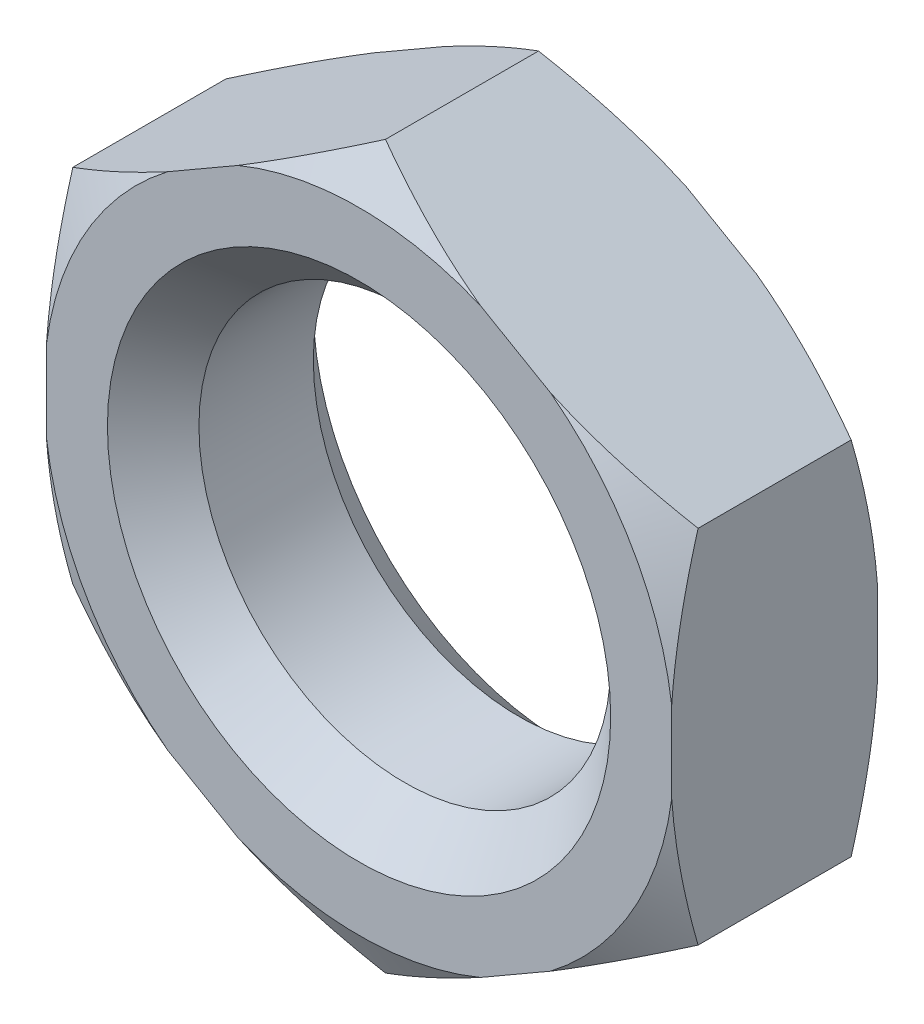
ISO-10303-21;
HEADER;
FILE_DESCRIPTION(('STEP AP214'),'2;1');
FILE_NAME('part.step','',(''),(''),'','','');
FILE_SCHEMA(('AUTOMOTIVE_DESIGN { 1 0 10303 214 1 1 1 1 }'));
ENDSEC;
DATA;
#1=APPLICATION_CONTEXT('core data for automotive mechanical design processes');
#2=APPLICATION_PROTOCOL_DEFINITION('international standard','automotive_design',2000,#1);
#3=PRODUCT_CONTEXT('',#1,'mechanical');
#4=PRODUCT('Part','Part','',(#3));
#5=PRODUCT_RELATED_PRODUCT_CATEGORY('part','',(#4));
#6=PRODUCT_DEFINITION_FORMATION('','',#4);
#7=PRODUCT_DEFINITION_CONTEXT('part definition',#1,'design');
#8=PRODUCT_DEFINITION('design','',#6,#7);
#9=PRODUCT_DEFINITION_SHAPE('','',#8);
#10=(LENGTH_UNIT() NAMED_UNIT(*) SI_UNIT(.MILLI.,.METRE.));
#11=(NAMED_UNIT(*) PLANE_ANGLE_UNIT() SI_UNIT($,.RADIAN.));
#12=(NAMED_UNIT(*) SI_UNIT($,.STERADIAN.) SOLID_ANGLE_UNIT());
#13=UNCERTAINTY_MEASURE_WITH_UNIT(LENGTH_MEASURE(1.E-05),#10,'distance_accuracy_value','');
#14=(GEOMETRIC_REPRESENTATION_CONTEXT(3) GLOBAL_UNCERTAINTY_ASSIGNED_CONTEXT((#13)) GLOBAL_UNIT_ASSIGNED_CONTEXT((#10,
#11,#12)) REPRESENTATION_CONTEXT('',''));
#15=CARTESIAN_POINT('',(0.,0.,0.));
#16=DIRECTION('',(0.,0.,1.));
#17=DIRECTION('',(1.,0.,0.));
#18=AXIS2_PLACEMENT_3D('',#15,#16,#17);
#19=CARTESIAN_POINT('',(20.5,11.8356805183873,6.75));
#20=DIRECTION('',(-0.5,-0.866025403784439,0.));
#21=DIRECTION('',(0.866025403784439,-0.5,0.));
#22=AXIS2_PLACEMENT_3D('',#19,#20,#21);
#23=PLANE('',#22);
#24=CARTESIAN_POINT('',(-14.2409864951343,31.8933984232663,1.48131712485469));
#25=CARTESIAN_POINT('',(-13.9189281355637,31.7074579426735,1.30748385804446));
#26=CARTESIAN_POINT('',(-13.5964796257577,31.5212922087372,1.13461500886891));
#27=CARTESIAN_POINT('',(-12.9507339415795,31.1484707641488,0.790994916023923));
#28=CARTESIAN_POINT('',(-12.6274367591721,30.9618150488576,0.620243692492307));
#29=CARTESIAN_POINT('',(-11.6561034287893,30.4010154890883,0.111415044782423));
#30=CARTESIAN_POINT('',(-11.0067004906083,30.026082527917,-0.223196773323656));
#31=CARTESIAN_POINT('',(-9.70158396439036,29.2725731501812,-0.882354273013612));
#32=CARTESIAN_POINT('',(-9.04585681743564,28.8939889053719,-1.2068642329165));
#33=CARTESIAN_POINT('',(-7.72949167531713,28.133985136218,-1.84229493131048));
#34=CARTESIAN_POINT('',(-7.06885383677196,27.7525657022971,-2.15321610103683));
#35=CARTESIAN_POINT('',(-5.72499220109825,26.9766868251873,-2.76619091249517));
#36=CARTESIAN_POINT('',(-5.04162159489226,26.5821426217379,-3.06781725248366));
#37=CARTESIAN_POINT('',(-3.66798213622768,25.7890715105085,-3.64959958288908));
#38=CARTESIAN_POINT('',(-2.977712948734,25.3905444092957,-3.92975452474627));
#39=CARTESIAN_POINT('',(-1.59014658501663,24.589432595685,-4.46326026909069));
#40=CARTESIAN_POINT('',(-0.892856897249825,24.1868522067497,-4.71663687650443));
#41=CARTESIAN_POINT('',(0.510003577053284,23.3769103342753,-5.19075414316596));
#42=CARTESIAN_POINT('',(1.21557328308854,22.9695494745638,-5.41149901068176));
#43=CARTESIAN_POINT('',(2.41398390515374,22.2776467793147,-5.75068006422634));
#44=CARTESIAN_POINT('',(2.90460738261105,21.994385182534,-5.87956301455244));
#45=CARTESIAN_POINT('',(3.88970625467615,21.4256380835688,-6.11605302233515));
#46=CARTESIAN_POINT('',(4.38418156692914,21.1401526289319,-6.22366053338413));
#47=CARTESIAN_POINT('',(5.37645600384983,20.5672627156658,-6.41516789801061));
#48=CARTESIAN_POINT('',(5.87425423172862,20.2798587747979,-6.49907390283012));
#49=CARTESIAN_POINT('',(6.87262545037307,19.7034488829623,-6.64105800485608));
#50=CARTESIAN_POINT('',(7.37319841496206,19.4144429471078,-6.69913634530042));
#51=CARTESIAN_POINT('',(8.37035554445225,18.8387340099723,-6.78729128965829));
#52=CARTESIAN_POINT('',(8.86691848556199,18.552043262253,-6.81768537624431));
#53=CARTESIAN_POINT('',(9.86073734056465,17.9782616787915,-6.85071462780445));
#54=CARTESIAN_POINT('',(10.357993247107,17.6911708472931,-6.8533500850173));
#55=CARTESIAN_POINT('',(11.3520253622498,17.1172661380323,-6.83077947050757));
#56=CARTESIAN_POINT('',(11.8488015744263,16.8304522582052,-6.80557360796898));
#57=CARTESIAN_POINT('',(12.8408198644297,16.2577102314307,-6.72808313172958));
#58=CARTESIAN_POINT('',(13.336061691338,15.9717822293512,-6.67579430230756));
#59=CARTESIAN_POINT('',(14.5056185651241,15.2965382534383,-6.52165616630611));
#60=CARTESIAN_POINT('',(15.178839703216,14.9078538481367,-6.40865424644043));
#61=CARTESIAN_POINT('',(16.5188482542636,14.134199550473,-6.13999268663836));
#62=CARTESIAN_POINT('',(17.1856347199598,13.7492302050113,-5.98432686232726));
#63=CARTESIAN_POINT('',(18.5126886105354,12.9830552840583,-5.63621314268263));
#64=CARTESIAN_POINT('',(19.1729477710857,12.6018544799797,-5.44372367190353));
#65=CARTESIAN_POINT('',(20.4860580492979,11.8437299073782,-5.02802775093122));
#66=CARTESIAN_POINT('',(21.1389096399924,11.4668058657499,-4.80482327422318));
#67=CARTESIAN_POINT('',(22.4453992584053,10.7125037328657,-4.33018749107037));
#68=CARTESIAN_POINT('',(23.0989534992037,10.3351740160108,-4.07845081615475));
#69=CARTESIAN_POINT('',(24.3991376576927,9.58451234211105,-3.55380858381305));
#70=CARTESIAN_POINT('',(25.0457718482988,9.21117791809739,-3.28091706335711));
#71=CARTESIAN_POINT('',(26.3331080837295,8.46793399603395,-2.71773235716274));
#72=CARTESIAN_POINT('',(26.9738116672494,8.09802360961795,-2.42744383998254));
#73=CARTESIAN_POINT('',(28.2502670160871,7.361061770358,-1.83246297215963));
#74=CARTESIAN_POINT('',(28.8860181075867,6.99401070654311,-1.52776870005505));
#75=CARTESIAN_POINT('',(29.9607373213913,6.37352127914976,-1.00083207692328));
#76=CARTESIAN_POINT('',(30.400835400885,6.1194305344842,-0.781649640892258));
#77=CARTESIAN_POINT('',(31.279095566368,5.61236679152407,-0.338219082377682));
#78=CARTESIAN_POINT('',(31.7172577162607,5.3593937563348,-0.113971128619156));
#79=CARTESIAN_POINT('',(32.5872155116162,4.85712338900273,0.336593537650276));
#80=CARTESIAN_POINT('',(33.019029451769,4.60781549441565,0.562863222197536));
#81=CARTESIAN_POINT('',(33.8811219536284,4.1100861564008,1.01929385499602));
#82=CARTESIAN_POINT('',(34.3114004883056,3.86166472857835,1.24945487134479));
#83=CARTESIAN_POINT('',(34.7409864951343,3.61364313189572,1.48131712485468));
#84=B_SPLINE_CURVE_WITH_KNOTS('',3,(#24,#25,#26,#27,#28,#29,#30,#31,#32,#33,#34,#35,#36,#37,#38,
#39,#40,#41,#42,#43,#44,#45,#46,#47,#48,#49,#50,#51,#52,#53,#54,#55,#56,#57,#58,#59,#60,#61,#62,
#63,#64,#65,#66,#67,#68,#69,#70,#71,#72,#73,#74,#75,#76,#77,#78,#79,#80,#81,#82,#83),
.UNSPECIFIED.,.F.,.F.,(4,2,2,2,2,2,2,2,2,2,2,2,2,2,2,2,2,2,2,2,2,2,2,2,2,2,2,2,2,4),(0.,
1.2315091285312,2.46302995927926,4.9263585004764,7.397586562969,9.86873614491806,
12.4028003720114,14.9369882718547,17.4687113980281,20.0001077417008,21.7427572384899,
23.4853695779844,25.2275292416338,26.9696724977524,28.6915756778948,30.4134607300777,
32.1353328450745,33.8574730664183,36.2126656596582,38.5681998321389,40.9264093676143,
43.2844674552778,45.6706973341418,48.0553572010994,50.439379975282,52.8237216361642,
54.4839971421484,56.1442174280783,57.7868630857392,59.4295375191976),.UNSPECIFIED.);
#85=CARTESIAN_POINT('',(0.,23.6713610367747,-5.01794919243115));
#86=VERTEX_POINT('',#85);
#87=CARTESIAN_POINT('',(7.9497010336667,19.0815990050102,-6.75));
#88=VERTEX_POINT('',#87);
#89=EDGE_CURVE('E177',#86,#88,#84,.T.);
#90=ORIENTED_EDGE('',*,*,#89,.F.);
#91=DIRECTION('',(0.,0.,-1.));
#92=VECTOR('',#91,1.);
#93=CARTESIAN_POINT('',(0.,23.6713610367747,6.75));
#94=LINE('',#93,#92);
#95=CARTESIAN_POINT('',(0.,23.6713610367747,5.01794919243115));
#96=VERTEX_POINT('',#95);
#97=EDGE_CURVE('E223',#96,#86,#94,.T.);
#98=ORIENTED_EDGE('',*,*,#97,.F.);
#99=CARTESIAN_POINT('',(34.7409864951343,3.61364313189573,-1.48131712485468));
#100=CARTESIAN_POINT('',(34.4189281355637,3.79958361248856,-1.30748385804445));
#101=CARTESIAN_POINT('',(34.0964796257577,3.98574934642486,-1.1346150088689));
#102=CARTESIAN_POINT('',(33.4507339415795,4.35857079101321,-0.790994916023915));
#103=CARTESIAN_POINT('',(33.1274367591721,4.54522650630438,-0.620243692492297));
#104=CARTESIAN_POINT('',(32.1561034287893,5.1060260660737,-0.111415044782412));
#105=CARTESIAN_POINT('',(31.5067004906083,5.48095902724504,0.223196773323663));
#106=CARTESIAN_POINT('',(30.2015839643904,6.23446840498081,0.882354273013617));
#107=CARTESIAN_POINT('',(29.5458568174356,6.61305264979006,1.20686423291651));
#108=CARTESIAN_POINT('',(28.2294916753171,7.37305641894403,1.84229493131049));
#109=CARTESIAN_POINT('',(27.568853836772,7.75447585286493,2.15321610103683));
#110=CARTESIAN_POINT('',(26.2249922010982,8.53035472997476,2.76619091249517));
#111=CARTESIAN_POINT('',(25.5416215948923,8.92489893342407,3.06781725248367));
#112=CARTESIAN_POINT('',(24.1679821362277,9.71797004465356,3.64959958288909));
#113=CARTESIAN_POINT('',(23.477712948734,10.1164971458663,3.92975452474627));
#114=CARTESIAN_POINT('',(22.0901465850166,10.917608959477,4.4632602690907));
#115=CARTESIAN_POINT('',(21.3928568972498,11.3201893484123,4.71663687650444));
#116=CARTESIAN_POINT('',(19.9899964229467,12.1301312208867,5.19075414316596));
#117=CARTESIAN_POINT('',(19.2844267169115,12.5374920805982,5.41149901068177));
#118=CARTESIAN_POINT('',(18.0860160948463,13.2293947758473,5.75068006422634));
#119=CARTESIAN_POINT('',(17.5953926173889,13.512656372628,5.87956301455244));
#120=CARTESIAN_POINT('',(16.6102937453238,14.0814034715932,6.11605302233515));
#121=CARTESIAN_POINT('',(16.1158184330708,14.3668889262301,6.22366053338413));
#122=CARTESIAN_POINT('',(15.1235439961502,14.9397788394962,6.41516789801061));
#123=CARTESIAN_POINT('',(14.6257457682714,15.2271827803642,6.49907390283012));
#124=CARTESIAN_POINT('',(13.6273745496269,15.8035926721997,6.64105800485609));
#125=CARTESIAN_POINT('',(13.1268015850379,16.0925986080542,6.69913634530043));
#126=CARTESIAN_POINT('',(12.1296444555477,16.6683075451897,6.7872912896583));
#127=CARTESIAN_POINT('',(11.633081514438,16.954998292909,6.81768537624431));
#128=CARTESIAN_POINT('',(10.6392626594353,17.5287798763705,6.85071462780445));
#129=CARTESIAN_POINT('',(10.142006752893,17.8158707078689,6.8533500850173));
#130=CARTESIAN_POINT('',(9.14797463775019,18.3897754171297,6.83077947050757));
#131=CARTESIAN_POINT('',(8.65119842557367,18.6765892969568,6.80557360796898));
#132=CARTESIAN_POINT('',(7.65918013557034,19.2493313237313,6.72808313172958));
#133=CARTESIAN_POINT('',(7.16393830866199,19.5352593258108,6.67579430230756));
#134=CARTESIAN_POINT('',(5.99438143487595,20.2105033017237,6.5216561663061));
#135=CARTESIAN_POINT('',(5.32116029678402,20.5991877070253,6.40865424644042));
#136=CARTESIAN_POINT('',(3.98115174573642,21.372842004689,6.13999268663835));
#137=CARTESIAN_POINT('',(3.31436528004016,21.7578113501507,5.98432686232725));
#138=CARTESIAN_POINT('',(1.98731138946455,22.5239862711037,5.63621314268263));
#139=CARTESIAN_POINT('',(1.32705222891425,22.9051870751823,5.44372367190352));
#140=CARTESIAN_POINT('',(0.0139419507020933,23.6633116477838,5.02802775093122));
#141=CARTESIAN_POINT('',(-0.638909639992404,24.0402356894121,4.80482327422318));
#142=CARTESIAN_POINT('',(-1.9453992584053,24.7945378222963,4.33018749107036));
#143=CARTESIAN_POINT('',(-2.59895349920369,25.1718675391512,4.07845081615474));
#144=CARTESIAN_POINT('',(-3.89913765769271,25.922529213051,3.55380858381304));
#145=CARTESIAN_POINT('',(-4.54577184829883,26.2958636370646,3.2809170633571));
#146=CARTESIAN_POINT('',(-5.83310808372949,27.0391075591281,2.71773235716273));
#147=CARTESIAN_POINT('',(-6.47381166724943,27.4090179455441,2.42744383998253));
#148=CARTESIAN_POINT('',(-7.75026701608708,28.145979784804,1.83246297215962));
#149=CARTESIAN_POINT('',(-8.38601810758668,28.5130308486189,1.52776870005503));
#150=CARTESIAN_POINT('',(-9.46073732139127,29.1335202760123,1.00083207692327));
#151=CARTESIAN_POINT('',(-9.90083540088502,29.3876110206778,0.781649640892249));
#152=CARTESIAN_POINT('',(-10.779095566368,29.8946747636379,0.338219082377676));
#153=CARTESIAN_POINT('',(-11.2172577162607,30.1476477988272,0.113971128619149));
#154=CARTESIAN_POINT('',(-12.0872155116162,30.6499181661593,-0.336593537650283));
#155=CARTESIAN_POINT('',(-12.519029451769,30.8992260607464,-0.562863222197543));
#156=CARTESIAN_POINT('',(-13.3811219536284,31.3969553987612,-1.01929385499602));
#157=CARTESIAN_POINT('',(-13.8114004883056,31.6453768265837,-1.2494548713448));
#158=CARTESIAN_POINT('',(-14.2409864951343,31.8933984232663,-1.48131712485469));
#159=B_SPLINE_CURVE_WITH_KNOTS('',3,(#99,#100,#101,#102,#103,#104,#105,#106,#107,#108,#109,#110,
#111,#112,#113,#114,#115,#116,#117,#118,#119,#120,#121,#122,#123,#124,#125,#126,#127,#128,#129,
#130,#131,#132,#133,#134,#135,#136,#137,#138,#139,#140,#141,#142,#143,#144,#145,#146,#147,#148,
#149,#150,#151,#152,#153,#154,#155,#156,#157,#158),.UNSPECIFIED.,.F.,.F.,(4,2,2,2,2,2,2,2,2,2,2,
2,2,2,2,2,2,2,2,2,2,2,2,2,2,2,2,2,2,4),(0.,1.2315091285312,2.46302995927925,4.92635850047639,
7.397586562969,9.86873614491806,12.4028003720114,14.9369882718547,17.4687113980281,
20.0001077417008,21.7427572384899,23.4853695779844,25.2275292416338,26.9696724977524,
28.6915756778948,30.4134607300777,32.1353328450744,33.8574730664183,36.2126656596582,
38.5681998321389,40.9264093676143,43.2844674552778,45.6706973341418,48.0553572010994,
50.439379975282,52.8237216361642,54.4839971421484,56.1442174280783,57.7868630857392,
59.4295375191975),.UNSPECIFIED.);
#160=CARTESIAN_POINT('',(7.9497010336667,19.0815990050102,6.75));
#161=VERTEX_POINT('',#160);
#162=EDGE_CURVE('E374',#161,#96,#159,.T.);
#163=ORIENTED_EDGE('',*,*,#162,.F.);
#164=DIRECTION('',(-0.866025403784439,0.5,0.));
#165=VECTOR('',#164,1.);
#166=CARTESIAN_POINT('',(20.5,11.8356805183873,6.75));
#167=LINE('',#166,#165);
#168=CARTESIAN_POINT('',(12.5502989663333,16.4254425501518,6.75));
#169=VERTEX_POINT('',#168);
#170=EDGE_CURVE('E353',#169,#161,#167,.T.);
#171=ORIENTED_EDGE('',*,*,#170,.F.);
#172=CARTESIAN_POINT('',(20.5,11.8356805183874,5.01794919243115));
#173=VERTEX_POINT('',#172);
#174=EDGE_CURVE('E194',#173,#169,#159,.T.);
#175=ORIENTED_EDGE('',*,*,#174,.F.);
#176=DIRECTION('',(0.,0.,-1.));
#177=VECTOR('',#176,1.);
#178=CARTESIAN_POINT('',(20.5,11.8356805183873,6.75));
#179=LINE('',#178,#177);
#180=CARTESIAN_POINT('',(20.5,11.8356805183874,-5.01794919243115));
#181=VERTEX_POINT('',#180);
#182=EDGE_CURVE('E183',#173,#181,#179,.T.);
#183=ORIENTED_EDGE('',*,*,#182,.T.);
#184=CARTESIAN_POINT('',(12.5502989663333,16.4254425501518,-6.75));
#185=VERTEX_POINT('',#184);
#186=EDGE_CURVE('E164',#185,#181,#84,.T.);
#187=ORIENTED_EDGE('',*,*,#186,.F.);
#188=DIRECTION('',(-0.866025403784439,0.5,0.));
#189=VECTOR('',#188,1.);
#190=CARTESIAN_POINT('',(20.5,11.8356805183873,-6.75));
#191=LINE('',#190,#189);
#192=EDGE_CURVE('E266',#185,#88,#191,.T.);
#193=ORIENTED_EDGE('',*,*,#192,.T.);
#194=EDGE_LOOP('',(#90,#98,#163,#171,#175,#183,#187,#193));
#195=FACE_BOUND('',#194,.T.);
#196=ADVANCED_FACE('F39',(#195),#23,.F.);
#197=CARTESIAN_POINT('',(0.,23.6713610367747,6.75));
#198=DIRECTION('',(0.5,-0.866025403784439,0.));
#199=DIRECTION('',(0.866025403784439,0.5,0.));
#200=AXIS2_PLACEMENT_3D('',#197,#198,#199);
#201=PLANE('',#200);
#202=CARTESIAN_POINT('',(-34.7409864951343,3.61364313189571,1.48131712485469));
#203=CARTESIAN_POINT('',(-34.4189281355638,3.79958361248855,1.30748385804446));
#204=CARTESIAN_POINT('',(-34.0964796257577,3.98574934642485,1.13461500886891));
#205=CARTESIAN_POINT('',(-33.4507339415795,4.3585707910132,0.790994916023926));
#206=CARTESIAN_POINT('',(-33.1274367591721,4.54522650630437,0.620243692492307));
#207=CARTESIAN_POINT('',(-32.1561034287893,5.10602606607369,0.11141504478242));
#208=CARTESIAN_POINT('',(-31.5067004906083,5.48095902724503,-0.223196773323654));
#209=CARTESIAN_POINT('',(-30.2015839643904,6.2344684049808,-0.882354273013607));
#210=CARTESIAN_POINT('',(-29.5458568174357,6.61305264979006,-1.2068642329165));
#211=CARTESIAN_POINT('',(-28.2294916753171,7.37305641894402,-1.84229493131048));
#212=CARTESIAN_POINT('',(-27.568853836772,7.75447585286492,-2.15321610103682));
#213=CARTESIAN_POINT('',(-26.2249922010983,8.53035472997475,-2.76619091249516));
#214=CARTESIAN_POINT('',(-25.5416215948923,8.92489893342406,-3.06781725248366));
#215=CARTESIAN_POINT('',(-24.1679821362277,9.71797004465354,-3.64959958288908));
#216=CARTESIAN_POINT('',(-23.477712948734,10.1164971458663,-3.92975452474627));
#217=CARTESIAN_POINT('',(-22.0901465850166,10.917608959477,-4.46326026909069));
#218=CARTESIAN_POINT('',(-21.3928568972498,11.3201893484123,-4.71663687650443));
#219=CARTESIAN_POINT('',(-19.9899964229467,12.1301312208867,-5.19075414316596));
#220=CARTESIAN_POINT('',(-19.2844267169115,12.5374920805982,-5.41149901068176));
#221=CARTESIAN_POINT('',(-18.0860160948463,13.2293947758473,-5.75068006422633));
#222=CARTESIAN_POINT('',(-17.595392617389,13.512656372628,-5.87956301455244));
#223=CARTESIAN_POINT('',(-16.6102937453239,14.0814034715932,-6.11605302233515));
#224=CARTESIAN_POINT('',(-16.1158184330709,14.3668889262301,-6.22366053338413));
#225=CARTESIAN_POINT('',(-15.1235439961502,14.9397788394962,-6.41516789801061));
#226=CARTESIAN_POINT('',(-14.6257457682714,15.2271827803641,-6.49907390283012));
#227=CARTESIAN_POINT('',(-13.6273745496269,15.8035926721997,-6.64105800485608));
#228=CARTESIAN_POINT('',(-13.126801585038,16.0925986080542,-6.69913634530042));
#229=CARTESIAN_POINT('',(-12.1296444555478,16.6683075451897,-6.78729128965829));
#230=CARTESIAN_POINT('',(-11.633081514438,16.954998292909,-6.81768537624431));
#231=CARTESIAN_POINT('',(-10.6392626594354,17.5287798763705,-6.85071462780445));
#232=CARTESIAN_POINT('',(-10.142006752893,17.8158707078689,-6.8533500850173));
#233=CARTESIAN_POINT('',(-9.14797463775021,18.3897754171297,-6.83077947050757));
#234=CARTESIAN_POINT('',(-8.65119842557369,18.6765892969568,-6.80557360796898));
#235=CARTESIAN_POINT('',(-7.65918013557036,19.2493313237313,-6.72808313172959));
#236=CARTESIAN_POINT('',(-7.16393830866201,19.5352593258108,-6.67579430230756));
#237=CARTESIAN_POINT('',(-5.99438143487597,20.2105033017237,-6.52165616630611));
#238=CARTESIAN_POINT('',(-5.32116029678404,20.5991877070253,-6.40865424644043));
#239=CARTESIAN_POINT('',(-3.98115174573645,21.372842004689,-6.13999268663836));
#240=CARTESIAN_POINT('',(-3.31436528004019,21.7578113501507,-5.98432686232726));
#241=CARTESIAN_POINT('',(-1.98731138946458,22.5239862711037,-5.63621314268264));
#242=CARTESIAN_POINT('',(-1.32705222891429,22.9051870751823,-5.44372367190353));
#243=CARTESIAN_POINT('',(-0.0139419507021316,23.6633116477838,-5.02802775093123));
#244=CARTESIAN_POINT('',(0.638909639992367,24.0402356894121,-4.80482327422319));
#245=CARTESIAN_POINT('',(1.94539925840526,24.7945378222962,-4.33018749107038));
#246=CARTESIAN_POINT('',(2.59895349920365,25.1718675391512,-4.07845081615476));
#247=CARTESIAN_POINT('',(3.89913765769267,25.9225292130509,-3.55380858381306));
#248=CARTESIAN_POINT('',(4.54577184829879,26.2958636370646,-3.28091706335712));
#249=CARTESIAN_POINT('',(5.83310808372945,27.039107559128,-2.71773235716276));
#250=CARTESIAN_POINT('',(6.47381166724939,27.409017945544,-2.42744383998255));
#251=CARTESIAN_POINT('',(7.75026701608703,28.145979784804,-1.83246297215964));
#252=CARTESIAN_POINT('',(8.38601810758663,28.5130308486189,-1.52776870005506));
#253=CARTESIAN_POINT('',(9.46073732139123,29.1335202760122,-1.00083207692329));
#254=CARTESIAN_POINT('',(9.90083540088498,29.3876110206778,-0.781649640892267));
#255=CARTESIAN_POINT('',(10.779095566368,29.8946747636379,-0.338219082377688));
#256=CARTESIAN_POINT('',(11.2172577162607,30.1476477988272,-0.11397112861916));
#257=CARTESIAN_POINT('',(12.0872155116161,30.6499181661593,0.336593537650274));
#258=CARTESIAN_POINT('',(12.519029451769,30.8992260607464,0.562863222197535));
#259=CARTESIAN_POINT('',(13.3811219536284,31.3969553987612,1.01929385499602));
#260=CARTESIAN_POINT('',(13.8114004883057,31.6453768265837,1.2494548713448));
#261=CARTESIAN_POINT('',(14.2409864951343,31.8933984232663,1.48131712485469));
#262=B_SPLINE_CURVE_WITH_KNOTS('',3,(#202,#203,#204,#205,#206,#207,#208,#209,#210,#211,#212,
#213,#214,#215,#216,#217,#218,#219,#220,#221,#222,#223,#224,#225,#226,#227,#228,#229,#230,#231,
#232,#233,#234,#235,#236,#237,#238,#239,#240,#241,#242,#243,#244,#245,#246,#247,#248,#249,#250,
#251,#252,#253,#254,#255,#256,#257,#258,#259,#260,#261),.UNSPECIFIED.,.F.,.F.,(4,2,2,2,2,2,2,2,
2,2,2,2,2,2,2,2,2,2,2,2,2,2,2,2,2,2,2,2,2,4),(0.,1.23150912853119,2.46302995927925,
4.92635850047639,7.397586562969,9.86873614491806,12.4028003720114,14.9369882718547,
17.4687113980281,20.0001077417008,21.7427572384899,23.4853695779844,25.2275292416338,
26.9696724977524,28.6915756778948,30.4134607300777,32.1353328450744,33.8574730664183,
36.2126656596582,38.5681998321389,40.9264093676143,43.2844674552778,45.6706973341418,
48.0553572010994,50.439379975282,52.8237216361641,54.4839971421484,56.1442174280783,
57.7868630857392,59.4295375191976),.UNSPECIFIED.);
#263=CARTESIAN_POINT('',(-20.5,11.8356805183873,-5.01794919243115));
#264=VERTEX_POINT('',#263);
#265=CARTESIAN_POINT('',(-12.5502989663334,16.4254425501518,-6.75));
#266=VERTEX_POINT('',#265);
#267=EDGE_CURVE('E55',#264,#266,#262,.T.);
#268=ORIENTED_EDGE('',*,*,#267,.F.);
#269=DIRECTION('',(0.,0.,-1.));
#270=VECTOR('',#269,1.);
#271=CARTESIAN_POINT('',(-20.5,11.8356805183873,6.75));
#272=LINE('',#271,#270);
#273=CARTESIAN_POINT('',(-20.5,11.8356805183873,5.01794919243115));
#274=VERTEX_POINT('',#273);
#275=EDGE_CURVE('E219',#274,#264,#272,.T.);
#276=ORIENTED_EDGE('',*,*,#275,.F.);
#277=CARTESIAN_POINT('',(14.2409864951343,31.8933984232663,-1.4813171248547));
#278=CARTESIAN_POINT('',(13.9189281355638,31.7074579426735,-1.30748385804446));
#279=CARTESIAN_POINT('',(13.5964796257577,31.5212922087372,-1.13461500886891));
#280=CARTESIAN_POINT('',(12.9507339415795,31.1484707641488,-0.790994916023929));
#281=CARTESIAN_POINT('',(12.6274367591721,30.9618150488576,-0.620243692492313));
#282=CARTESIAN_POINT('',(11.6561034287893,30.4010154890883,-0.111415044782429));
#283=CARTESIAN_POINT('',(11.0067004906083,30.026082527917,0.223196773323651));
#284=CARTESIAN_POINT('',(9.70158396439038,29.2725731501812,0.882354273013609));
#285=CARTESIAN_POINT('',(9.04585681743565,28.8939889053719,1.2068642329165));
#286=CARTESIAN_POINT('',(7.72949167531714,28.133985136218,1.84229493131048));
#287=CARTESIAN_POINT('',(7.06885383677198,27.7525657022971,2.15321610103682));
#288=CARTESIAN_POINT('',(5.72499220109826,26.9766868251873,2.76619091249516));
#289=CARTESIAN_POINT('',(5.04162159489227,26.5821426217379,3.06781725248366));
#290=CARTESIAN_POINT('',(3.66798213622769,25.7890715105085,3.64959958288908));
#291=CARTESIAN_POINT('',(2.97771294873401,25.3905444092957,3.92975452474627));
#292=CARTESIAN_POINT('',(1.59014658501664,24.589432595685,4.46326026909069));
#293=CARTESIAN_POINT('',(0.892856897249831,24.1868522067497,4.71663687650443));
#294=CARTESIAN_POINT('',(-0.510003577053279,23.3769103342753,5.19075414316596));
#295=CARTESIAN_POINT('',(-1.21557328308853,22.9695494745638,5.41149901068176));
#296=CARTESIAN_POINT('',(-2.41398390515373,22.2776467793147,5.75068006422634));
#297=CARTESIAN_POINT('',(-2.90460738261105,21.994385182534,5.87956301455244));
#298=CARTESIAN_POINT('',(-3.88970625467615,21.4256380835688,6.11605302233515));
#299=CARTESIAN_POINT('',(-4.38418156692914,21.1401526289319,6.22366053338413));
#300=CARTESIAN_POINT('',(-5.37645600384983,20.5672627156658,6.41516789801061));
#301=CARTESIAN_POINT('',(-5.87425423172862,20.2798587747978,6.49907390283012));
#302=CARTESIAN_POINT('',(-6.87262545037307,19.7034488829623,6.64105800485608));
#303=CARTESIAN_POINT('',(-7.37319841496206,19.4144429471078,6.69913634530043));
#304=CARTESIAN_POINT('',(-8.37035554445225,18.8387340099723,6.7872912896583));
#305=CARTESIAN_POINT('',(-8.86691848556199,18.552043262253,6.81768537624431));
#306=CARTESIAN_POINT('',(-9.86073734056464,17.9782616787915,6.85071462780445));
#307=CARTESIAN_POINT('',(-10.357993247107,17.6911708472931,6.8533500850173));
#308=CARTESIAN_POINT('',(-11.3520253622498,17.1172661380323,6.83077947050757));
#309=CARTESIAN_POINT('',(-11.8488015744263,16.8304522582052,6.80557360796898));
#310=CARTESIAN_POINT('',(-12.8408198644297,16.2577102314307,6.72808313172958));
#311=CARTESIAN_POINT('',(-13.336061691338,15.9717822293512,6.67579430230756));
#312=CARTESIAN_POINT('',(-14.5056185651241,15.2965382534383,6.52165616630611));
#313=CARTESIAN_POINT('',(-15.178839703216,14.9078538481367,6.40865424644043));
#314=CARTESIAN_POINT('',(-16.5188482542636,14.134199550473,6.13999268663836));
#315=CARTESIAN_POINT('',(-17.1856347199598,13.7492302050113,5.98432686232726));
#316=CARTESIAN_POINT('',(-18.5126886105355,12.9830552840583,5.63621314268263));
#317=CARTESIAN_POINT('',(-19.1729477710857,12.6018544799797,5.44372367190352));
#318=CARTESIAN_POINT('',(-20.4860580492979,11.8437299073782,5.02802775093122));
#319=CARTESIAN_POINT('',(-21.1389096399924,11.4668058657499,4.80482327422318));
#320=CARTESIAN_POINT('',(-22.4453992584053,10.7125037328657,4.33018749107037));
#321=CARTESIAN_POINT('',(-23.0989534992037,10.3351740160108,4.07845081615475));
#322=CARTESIAN_POINT('',(-24.3991376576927,9.58451234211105,3.55380858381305));
#323=CARTESIAN_POINT('',(-25.0457718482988,9.21117791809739,3.28091706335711));
#324=CARTESIAN_POINT('',(-26.3331080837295,8.46793399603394,2.71773235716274));
#325=CARTESIAN_POINT('',(-26.9738116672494,8.09802360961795,2.42744383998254));
#326=CARTESIAN_POINT('',(-28.2502670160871,7.361061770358,1.83246297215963));
#327=CARTESIAN_POINT('',(-28.8860181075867,6.9940107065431,1.52776870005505));
#328=CARTESIAN_POINT('',(-29.9607373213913,6.37352127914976,1.00083207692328));
#329=CARTESIAN_POINT('',(-30.400835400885,6.1194305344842,0.781649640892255));
#330=CARTESIAN_POINT('',(-31.279095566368,5.61236679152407,0.338219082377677));
#331=CARTESIAN_POINT('',(-31.7172577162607,5.35939375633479,0.11397112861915));
#332=CARTESIAN_POINT('',(-32.5872155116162,4.85712338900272,-0.336593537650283));
#333=CARTESIAN_POINT('',(-33.019029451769,4.60781549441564,-0.562863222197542));
#334=CARTESIAN_POINT('',(-33.8811219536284,4.11008615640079,-1.01929385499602));
#335=CARTESIAN_POINT('',(-34.3114004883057,3.86166472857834,-1.2494548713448));
#336=CARTESIAN_POINT('',(-34.7409864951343,3.61364313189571,-1.48131712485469));
#337=B_SPLINE_CURVE_WITH_KNOTS('',3,(#277,#278,#279,#280,#281,#282,#283,#284,#285,#286,#287,
#288,#289,#290,#291,#292,#293,#294,#295,#296,#297,#298,#299,#300,#301,#302,#303,#304,#305,#306,
#307,#308,#309,#310,#311,#312,#313,#314,#315,#316,#317,#318,#319,#320,#321,#322,#323,#324,#325,
#326,#327,#328,#329,#330,#331,#332,#333,#334,#335,#336),.UNSPECIFIED.,.F.,.F.,(4,2,2,2,2,2,2,2,
2,2,2,2,2,2,2,2,2,2,2,2,2,2,2,2,2,2,2,2,2,4),(0.,1.2315091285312,2.46302995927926,
4.9263585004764,7.39758656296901,9.86873614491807,12.4028003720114,14.9369882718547,
17.4687113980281,20.0001077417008,21.74275723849,23.4853695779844,25.2275292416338,
26.9696724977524,28.6915756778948,30.4134607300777,32.1353328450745,33.8574730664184,
36.2126656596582,38.5681998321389,40.9264093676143,43.2844674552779,45.6706973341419,
48.0553572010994,50.439379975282,52.8237216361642,54.4839971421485,56.1442174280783,
57.7868630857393,59.4295375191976),.UNSPECIFIED.);
#338=CARTESIAN_POINT('',(-12.5502989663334,16.4254425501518,6.75));
#339=VERTEX_POINT('',#338);
#340=EDGE_CURVE('E346',#339,#274,#337,.T.);
#341=ORIENTED_EDGE('',*,*,#340,.F.);
#342=DIRECTION('',(-0.866025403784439,-0.5,0.));
#343=VECTOR('',#342,1.);
#344=CARTESIAN_POINT('',(0.,23.6713610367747,6.75));
#345=LINE('',#344,#343);
#346=CARTESIAN_POINT('',(-7.94970103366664,19.0815990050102,6.75));
#347=VERTEX_POINT('',#346);
#348=EDGE_CURVE('E357',#347,#339,#345,.T.);
#349=ORIENTED_EDGE('',*,*,#348,.F.);
#350=EDGE_CURVE('E352',#96,#347,#337,.T.);
#351=ORIENTED_EDGE('',*,*,#350,.F.);
#352=ORIENTED_EDGE('',*,*,#97,.T.);
#353=CARTESIAN_POINT('',(-7.94970103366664,19.0815990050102,-6.75));
#354=VERTEX_POINT('',#353);
#355=EDGE_CURVE('E394',#354,#86,#262,.T.);
#356=ORIENTED_EDGE('',*,*,#355,.F.);
#357=DIRECTION('',(-0.866025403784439,-0.5,0.));
#358=VECTOR('',#357,1.);
#359=CARTESIAN_POINT('',(0.,23.6713610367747,-6.75));
#360=LINE('',#359,#358);
#361=EDGE_CURVE('E373',#354,#266,#360,.T.);
#362=ORIENTED_EDGE('',*,*,#361,.T.);
#363=EDGE_LOOP('',(#268,#276,#341,#349,#351,#352,#356,#362));
#364=FACE_BOUND('',#363,.T.);
#365=ADVANCED_FACE('F326',(#364),#201,.F.);
#366=CARTESIAN_POINT('',(-20.5,11.8356805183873,6.75));
#367=DIRECTION('',(1.,0.,0.));
#368=DIRECTION('',(0.,0.,-1.));
#369=AXIS2_PLACEMENT_3D('',#366,#367,#368);
#370=PLANE('',#369);
#371=CARTESIAN_POINT('',(-20.5,-26.0766670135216,0.466037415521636));
#372=CARTESIAN_POINT('',(-20.5,-25.7063519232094,0.297959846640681));
#373=CARTESIAN_POINT('',(-20.5,-25.3355252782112,0.131010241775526));
#374=CARTESIAN_POINT('',(-20.5,-24.5927579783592,-0.200405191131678));
#375=CARTESIAN_POINT('',(-20.5,-24.220817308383,-0.364870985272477));
#376=CARTESIAN_POINT('',(-20.5,-23.1030780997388,-0.854248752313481));
#377=CARTESIAN_POINT('',(-20.5,-22.3554865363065,-1.17508456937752));
#378=CARTESIAN_POINT('',(-20.5,-20.8516512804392,-1.80492037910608));
#379=CARTESIAN_POINT('',(-20.5,-20.0953844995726,-2.11386538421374));
#380=CARTESIAN_POINT('',(-20.5,-18.5764601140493,-2.71558777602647));
#381=CARTESIAN_POINT('',(-20.5,-17.8138028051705,-3.00836590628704));
#382=CARTESIAN_POINT('',(-20.5,-16.2845704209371,-3.57288628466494));
#383=CARTESIAN_POINT('',(-20.5,-15.518027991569,-3.84471653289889));
#384=CARTESIAN_POINT('',(-20.5,-13.9767509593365,-4.36437123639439));
#385=CARTESIAN_POINT('',(-20.5,-13.2020159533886,-4.61219450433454));
#386=CARTESIAN_POINT('',(-20.5,-11.6447192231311,-5.07816291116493));
#387=CARTESIAN_POINT('',(-20.5,-10.862169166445,-5.29634675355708));
#388=CARTESIAN_POINT('',(-20.5,-9.28801286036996,-5.69720275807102));
#389=CARTESIAN_POINT('',(-20.5,-8.49640789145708,-5.87987987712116));
#390=CARTESIAN_POINT('',(-20.5,-7.12991866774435,-6.15730640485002));
#391=CARTESIAN_POINT('',(-20.5,-6.5571149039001,-6.26230801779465));
#392=CARTESIAN_POINT('',(-20.5,-5.40759100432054,-6.44822552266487));
#393=CARTESIAN_POINT('',(-20.5,-4.83087099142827,-6.52914216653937));
#394=CARTESIAN_POINT('',(-20.5,-3.67447912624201,-6.66475101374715));
#395=CARTESIAN_POINT('',(-20.5,-3.09480805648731,-6.71944983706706));
#396=CARTESIAN_POINT('',(-20.5,-1.9334958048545,-6.8010653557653));
#397=CARTESIAN_POINT('',(-20.5,-1.35185462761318,-6.8279821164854));
#398=CARTESIAN_POINT('',(-20.5,-0.18824655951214,-6.85319416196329));
#399=CARTESIAN_POINT('',(-20.5,0.393720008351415,-6.85150421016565));
#400=CARTESIAN_POINT('',(-20.5,1.55685914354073,-6.81959284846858));
#401=CARTESIAN_POINT('',(-20.5,2.13803171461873,-6.78937157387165));
#402=CARTESIAN_POINT('',(-20.5,3.2983251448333,-6.70132043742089));
#403=CARTESIAN_POINT('',(-20.5,3.87744578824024,-6.64348775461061));
#404=CARTESIAN_POINT('',(-20.5,5.0324901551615,-6.50187860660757));
#405=CARTESIAN_POINT('',(-20.5,5.60841374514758,-6.41810106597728));
#406=CARTESIAN_POINT('',(-20.5,7.04356628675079,-6.1788534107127));
#407=CARTESIAN_POINT('',(-20.5,7.90032356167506,-6.00848733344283));
#408=CARTESIAN_POINT('',(-20.5,9.60355874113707,-5.62240789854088));
#409=CARTESIAN_POINT('',(-20.5,10.450034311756,-5.40668444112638));
#410=CARTESIAN_POINT('',(-20.5,12.1343868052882,-4.93752138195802));
#411=CARTESIAN_POINT('',(-20.5,12.9722405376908,-4.6839993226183));
#412=CARTESIAN_POINT('',(-20.5,14.6380666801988,-4.14678426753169));
#413=CARTESIAN_POINT('',(-20.5,15.4660397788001,-3.86309338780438));
#414=CARTESIAN_POINT('',(-20.5,17.1226753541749,-3.2680591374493));
#415=CARTESIAN_POINT('',(-20.5,17.9512366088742,-2.95643568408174));
#416=CARTESIAN_POINT('',(-20.5,19.6006067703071,-2.31325844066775));
#417=CARTESIAN_POINT('',(-20.5,20.421415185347,-1.98170339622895));
#418=CARTESIAN_POINT('',(-20.5,22.0512533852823,-1.30465108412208));
#419=CARTESIAN_POINT('',(-20.5,22.8603246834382,-0.959253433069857));
#420=CARTESIAN_POINT('',(-20.5,24.0695947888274,-0.431525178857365));
#421=CARTESIAN_POINT('',(-20.5,24.4719157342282,-0.254031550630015));
#422=CARTESIAN_POINT('',(-20.5,25.2752459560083,0.103881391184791));
#423=CARTESIAN_POINT('',(-20.5,25.6762552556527,0.284300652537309));
#424=CARTESIAN_POINT('',(-20.5,26.0766670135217,0.466037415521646));
#425=B_SPLINE_CURVE_WITH_KNOTS('',3,(#371,#372,#373,#374,#375,#376,#377,#378,#379,#380,#381,
#382,#383,#384,#385,#386,#387,#388,#389,#390,#391,#392,#393,#394,#395,#396,#397,#398,#399,#400,
#401,#402,#403,#404,#405,#406,#407,#408,#409,#410,#411,#412,#413,#414,#415,#416,#417,#418,#419,
#420,#421,#422,#423,#424),.UNSPECIFIED.,.F.,.F.,(4,2,2,2,2,2,2,2,2,2,2,2,2,2,2,2,2,2,2,2,2,2,2,
2,2,2,4),(0.,1.22001696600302,2.44005056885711,4.88052706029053,7.3311892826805,
9.78173869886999,12.221358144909,14.6610981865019,17.0976211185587,19.5338036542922,
21.2804033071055,23.0269484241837,24.7730523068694,26.5191520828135,28.2643507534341,
30.0095411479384,31.7549098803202,33.5003509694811,36.1193675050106,38.7389678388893,
41.3643687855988,43.989585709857,46.6449425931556,49.3004667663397,51.9394634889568,
53.258656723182,54.5778264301),.UNSPECIFIED.);
#426=CARTESIAN_POINT('',(-20.5,-11.8356805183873,-5.01794919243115));
#427=VERTEX_POINT('',#426);
#428=CARTESIAN_POINT('',(-20.5,-2.65615645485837,-6.75));
#429=VERTEX_POINT('',#428);
#430=EDGE_CURVE('E63',#427,#429,#425,.T.);
#431=ORIENTED_EDGE('',*,*,#430,.F.);
#432=DIRECTION('',(0.,0.,-1.));
#433=VECTOR('',#432,1.);
#434=CARTESIAN_POINT('',(-20.5,-11.8356805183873,6.75));
#435=LINE('',#434,#433);
#436=CARTESIAN_POINT('',(-20.5,-11.8356805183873,5.01794919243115));
#437=VERTEX_POINT('',#436);
#438=EDGE_CURVE('E215',#437,#427,#435,.T.);
#439=ORIENTED_EDGE('',*,*,#438,.F.);
#440=CARTESIAN_POINT('',(-20.5,26.0766670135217,-0.466037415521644));
#441=CARTESIAN_POINT('',(-20.5,25.7063519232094,-0.297959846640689));
#442=CARTESIAN_POINT('',(-20.5,25.3355252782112,-0.131010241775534));
#443=CARTESIAN_POINT('',(-20.5,24.5927579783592,0.200405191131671));
#444=CARTESIAN_POINT('',(-20.5,24.220817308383,0.364870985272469));
#445=CARTESIAN_POINT('',(-20.5,23.1030780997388,0.854248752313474));
#446=CARTESIAN_POINT('',(-20.5,22.3554865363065,1.17508456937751));
#447=CARTESIAN_POINT('',(-20.5,20.8516512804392,1.80492037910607));
#448=CARTESIAN_POINT('',(-20.5,20.0953844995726,2.11386538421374));
#449=CARTESIAN_POINT('',(-20.5,18.5764601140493,2.71558777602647));
#450=CARTESIAN_POINT('',(-20.5,17.8138028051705,3.00836590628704));
#451=CARTESIAN_POINT('',(-20.5,16.2845704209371,3.57288628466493));
#452=CARTESIAN_POINT('',(-20.5,15.518027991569,3.84471653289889));
#453=CARTESIAN_POINT('',(-20.5,13.9767509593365,4.36437123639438));
#454=CARTESIAN_POINT('',(-20.5,13.2020159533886,4.61219450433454));
#455=CARTESIAN_POINT('',(-20.5,11.6447192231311,5.07816291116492));
#456=CARTESIAN_POINT('',(-20.5,10.862169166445,5.29634675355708));
#457=CARTESIAN_POINT('',(-20.5,9.28801286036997,5.69720275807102));
#458=CARTESIAN_POINT('',(-20.5,8.49640789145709,5.87987987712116));
#459=CARTESIAN_POINT('',(-20.5,7.12991866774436,6.15730640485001));
#460=CARTESIAN_POINT('',(-20.5,6.55711490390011,6.26230801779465));
#461=CARTESIAN_POINT('',(-20.5,5.40759100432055,6.44822552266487));
#462=CARTESIAN_POINT('',(-20.5,4.83087099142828,6.52914216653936));
#463=CARTESIAN_POINT('',(-20.5,3.67447912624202,6.66475101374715));
#464=CARTESIAN_POINT('',(-20.5,3.09480805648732,6.71944983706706));
#465=CARTESIAN_POINT('',(-20.5,1.93349580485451,6.8010653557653));
#466=CARTESIAN_POINT('',(-20.5,1.3518546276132,6.8279821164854));
#467=CARTESIAN_POINT('',(-20.5,0.188246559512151,6.85319416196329));
#468=CARTESIAN_POINT('',(-20.5,-0.393720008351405,6.85150421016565));
#469=CARTESIAN_POINT('',(-20.5,-1.55685914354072,6.81959284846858));
#470=CARTESIAN_POINT('',(-20.5,-2.13803171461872,6.78937157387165));
#471=CARTESIAN_POINT('',(-20.5,-3.29832514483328,6.70132043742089));
#472=CARTESIAN_POINT('',(-20.5,-3.87744578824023,6.64348775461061));
#473=CARTESIAN_POINT('',(-20.5,-5.03249015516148,6.50187860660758));
#474=CARTESIAN_POINT('',(-20.5,-5.60841374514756,6.41810106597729));
#475=CARTESIAN_POINT('',(-20.5,-7.04356628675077,6.1788534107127));
#476=CARTESIAN_POINT('',(-20.5,-7.90032356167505,6.00848733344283));
#477=CARTESIAN_POINT('',(-20.5,-9.60355874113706,5.62240789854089));
#478=CARTESIAN_POINT('',(-20.5,-10.450034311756,5.40668444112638));
#479=CARTESIAN_POINT('',(-20.5,-12.1343868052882,4.93752138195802));
#480=CARTESIAN_POINT('',(-20.5,-12.9722405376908,4.6839993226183));
#481=CARTESIAN_POINT('',(-20.5,-14.6380666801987,4.1467842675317));
#482=CARTESIAN_POINT('',(-20.5,-15.4660397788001,3.86309338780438));
#483=CARTESIAN_POINT('',(-20.5,-17.1226753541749,3.26805913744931));
#484=CARTESIAN_POINT('',(-20.5,-17.9512366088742,2.95643568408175));
#485=CARTESIAN_POINT('',(-20.5,-19.6006067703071,2.31325844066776));
#486=CARTESIAN_POINT('',(-20.5,-20.421415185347,1.98170339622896));
#487=CARTESIAN_POINT('',(-20.5,-22.0512533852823,1.30465108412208));
#488=CARTESIAN_POINT('',(-20.5,-22.8603246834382,0.959253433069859));
#489=CARTESIAN_POINT('',(-20.5,-24.0695947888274,0.431525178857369));
#490=CARTESIAN_POINT('',(-20.5,-24.4719157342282,0.254031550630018));
#491=CARTESIAN_POINT('',(-20.5,-25.2752459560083,-0.103881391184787));
#492=CARTESIAN_POINT('',(-20.5,-25.6762552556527,-0.284300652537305));
#493=CARTESIAN_POINT('',(-20.5,-26.0766670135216,-0.466037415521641));
#494=B_SPLINE_CURVE_WITH_KNOTS('',3,(#440,#441,#442,#443,#444,#445,#446,#447,#448,#449,#450,
#451,#452,#453,#454,#455,#456,#457,#458,#459,#460,#461,#462,#463,#464,#465,#466,#467,#468,#469,
#470,#471,#472,#473,#474,#475,#476,#477,#478,#479,#480,#481,#482,#483,#484,#485,#486,#487,#488,
#489,#490,#491,#492,#493),.UNSPECIFIED.,.F.,.F.,(4,2,2,2,2,2,2,2,2,2,2,2,2,2,2,2,2,2,2,2,2,2,2,
2,2,2,4),(0.,1.22001696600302,2.44005056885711,4.88052706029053,7.3311892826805,
9.78173869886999,12.221358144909,14.6610981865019,17.0976211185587,19.5338036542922,
21.2804033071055,23.0269484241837,24.7730523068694,26.5191520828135,28.2643507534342,
30.0095411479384,31.7549098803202,33.5003509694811,36.1193675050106,38.7389678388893,
41.3643687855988,43.989585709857,46.6449425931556,49.3004667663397,51.9394634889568,
53.258656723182,54.5778264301),.UNSPECIFIED.);
#495=CARTESIAN_POINT('',(-20.5,-2.65615645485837,6.75));
#496=VERTEX_POINT('',#495);
#497=EDGE_CURVE('E332',#496,#437,#494,.T.);
#498=ORIENTED_EDGE('',*,*,#497,.F.);
#499=DIRECTION('',(0.,-1.,0.));
#500=VECTOR('',#499,1.);
#501=CARTESIAN_POINT('',(-20.5,11.8356805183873,6.75));
#502=LINE('',#501,#500);
#503=CARTESIAN_POINT('',(-20.5,2.65615645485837,6.75));
#504=VERTEX_POINT('',#503);
#505=EDGE_CURVE('E361',#504,#496,#502,.T.);
#506=ORIENTED_EDGE('',*,*,#505,.F.);
#507=EDGE_CURVE('E339',#274,#504,#494,.T.);
#508=ORIENTED_EDGE('',*,*,#507,.F.);
#509=ORIENTED_EDGE('',*,*,#275,.T.);
#510=CARTESIAN_POINT('',(-20.5,2.65615645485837,-6.75));
#511=VERTEX_POINT('',#510);
#512=EDGE_CURVE('E315',#511,#264,#425,.T.);
#513=ORIENTED_EDGE('',*,*,#512,.F.);
#514=DIRECTION('',(0.,-1.,0.));
#515=VECTOR('',#514,1.);
#516=CARTESIAN_POINT('',(-20.5,11.8356805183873,-6.75));
#517=LINE('',#516,#515);
#518=EDGE_CURVE('E378',#511,#429,#517,.T.);
#519=ORIENTED_EDGE('',*,*,#518,.T.);
#520=EDGE_LOOP('',(#431,#439,#498,#506,#508,#509,#513,#519));
#521=FACE_BOUND('',#520,.T.);
#522=ADVANCED_FACE('F322',(#521),#370,.F.);
#523=CARTESIAN_POINT('',(-20.5,-11.8356805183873,6.75));
#524=DIRECTION('',(0.5,0.866025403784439,0.));
#525=DIRECTION('',(-0.866025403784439,0.5,0.));
#526=AXIS2_PLACEMENT_3D('',#523,#524,#525);
#527=PLANE('',#526);
#528=CARTESIAN_POINT('',(14.2409864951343,-31.8933984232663,1.48131712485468));
#529=CARTESIAN_POINT('',(13.9189281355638,-31.7074579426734,1.30748385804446));
#530=CARTESIAN_POINT('',(13.5964796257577,-31.5212922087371,1.1346150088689));
#531=CARTESIAN_POINT('',(12.9507339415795,-31.1484707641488,0.790994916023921));
#532=CARTESIAN_POINT('',(12.6274367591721,-30.9618150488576,0.620243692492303));
#533=CARTESIAN_POINT('',(11.6561034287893,-30.4010154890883,0.111415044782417));
#534=CARTESIAN_POINT('',(11.0067004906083,-30.026082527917,-0.223196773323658));
#535=CARTESIAN_POINT('',(9.70158396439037,-29.2725731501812,-0.882354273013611));
#536=CARTESIAN_POINT('',(9.04585681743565,-28.8939889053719,-1.20686423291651));
#537=CARTESIAN_POINT('',(7.72949167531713,-28.133985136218,-1.84229493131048));
#538=CARTESIAN_POINT('',(7.06885383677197,-27.7525657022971,-2.15321610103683));
#539=CARTESIAN_POINT('',(5.72499220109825,-26.9766868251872,-2.76619091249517));
#540=CARTESIAN_POINT('',(5.04162159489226,-26.5821426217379,-3.06781725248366));
#541=CARTESIAN_POINT('',(3.66798213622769,-25.7890715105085,-3.64959958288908));
#542=CARTESIAN_POINT('',(2.97771294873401,-25.3905444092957,-3.92975452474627));
#543=CARTESIAN_POINT('',(1.59014658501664,-24.589432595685,-4.46326026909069));
#544=CARTESIAN_POINT('',(0.89285689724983,-24.1868522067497,-4.71663687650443));
#545=CARTESIAN_POINT('',(-0.51000357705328,-23.3769103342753,-5.19075414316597));
#546=CARTESIAN_POINT('',(-1.21557328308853,-22.9695494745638,-5.41149901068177));
#547=CARTESIAN_POINT('',(-2.41398390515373,-22.2776467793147,-5.75068006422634));
#548=CARTESIAN_POINT('',(-2.90460738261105,-21.994385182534,-5.87956301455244));
#549=CARTESIAN_POINT('',(-3.88970625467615,-21.4256380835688,-6.11605302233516));
#550=CARTESIAN_POINT('',(-4.38418156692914,-21.1401526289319,-6.22366053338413));
#551=CARTESIAN_POINT('',(-5.37645600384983,-20.5672627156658,-6.41516789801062));
#552=CARTESIAN_POINT('',(-5.87425423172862,-20.2798587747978,-6.49907390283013));
#553=CARTESIAN_POINT('',(-6.87262545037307,-19.7034488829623,-6.64105800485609));
#554=CARTESIAN_POINT('',(-7.37319841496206,-19.4144429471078,-6.69913634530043));
#555=CARTESIAN_POINT('',(-8.37035554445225,-18.8387340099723,-6.7872912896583));
#556=CARTESIAN_POINT('',(-8.86691848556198,-18.552043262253,-6.81768537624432));
#557=CARTESIAN_POINT('',(-9.86073734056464,-17.9782616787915,-6.85071462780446));
#558=CARTESIAN_POINT('',(-10.357993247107,-17.6911708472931,-6.85335008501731));
#559=CARTESIAN_POINT('',(-11.3520253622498,-17.1172661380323,-6.83077947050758));
#560=CARTESIAN_POINT('',(-11.8488015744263,-16.8304522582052,-6.80557360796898));
#561=CARTESIAN_POINT('',(-12.8408198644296,-16.2577102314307,-6.72808313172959));
#562=CARTESIAN_POINT('',(-13.336061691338,-15.9717822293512,-6.67579430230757));
#563=CARTESIAN_POINT('',(-14.505618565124,-15.2965382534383,-6.52165616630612));
#564=CARTESIAN_POINT('',(-15.178839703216,-14.9078538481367,-6.40865424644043));
#565=CARTESIAN_POINT('',(-16.5188482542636,-14.134199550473,-6.13999268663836));
#566=CARTESIAN_POINT('',(-17.1856347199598,-13.7492302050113,-5.98432686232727));
#567=CARTESIAN_POINT('',(-18.5126886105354,-12.9830552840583,-5.63621314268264));
#568=CARTESIAN_POINT('',(-19.1729477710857,-12.6018544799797,-5.44372367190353));
#569=CARTESIAN_POINT('',(-20.4860580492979,-11.8437299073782,-5.02802775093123));
#570=CARTESIAN_POINT('',(-21.1389096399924,-11.4668058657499,-4.80482327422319));
#571=CARTESIAN_POINT('',(-22.4453992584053,-10.7125037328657,-4.33018749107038));
#572=CARTESIAN_POINT('',(-23.0989534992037,-10.3351740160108,-4.07845081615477));
#573=CARTESIAN_POINT('',(-24.3991376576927,-9.58451234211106,-3.55380858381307));
#574=CARTESIAN_POINT('',(-25.0457718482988,-9.2111779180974,-3.28091706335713));
#575=CARTESIAN_POINT('',(-26.3331080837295,-8.46793399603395,-2.71773235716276));
#576=CARTESIAN_POINT('',(-26.9738116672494,-8.09802360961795,-2.42744383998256));
#577=CARTESIAN_POINT('',(-28.250267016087,-7.361061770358,-1.83246297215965));
#578=CARTESIAN_POINT('',(-28.8860181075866,-6.99401070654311,-1.52776870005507));
#579=CARTESIAN_POINT('',(-29.9607373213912,-6.37352127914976,-1.0008320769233));
#580=CARTESIAN_POINT('',(-30.400835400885,-6.11943053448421,-0.781649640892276));
#581=CARTESIAN_POINT('',(-31.279095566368,-5.61236679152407,-0.338219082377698));
#582=CARTESIAN_POINT('',(-31.7172577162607,-5.3593937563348,-0.11397112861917));
#583=CARTESIAN_POINT('',(-32.5872155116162,-4.85712338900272,0.336593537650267));
#584=CARTESIAN_POINT('',(-33.019029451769,-4.60781549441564,0.562863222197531));
#585=CARTESIAN_POINT('',(-33.8811219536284,-4.11008615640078,1.01929385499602));
#586=CARTESIAN_POINT('',(-34.3114004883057,-3.86166472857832,1.2494548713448));
#587=CARTESIAN_POINT('',(-34.7409864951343,-3.6136431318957,1.48131712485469));
#588=B_SPLINE_CURVE_WITH_KNOTS('',3,(#528,#529,#530,#531,#532,#533,#534,#535,#536,#537,#538,
#539,#540,#541,#542,#543,#544,#545,#546,#547,#548,#549,#550,#551,#552,#553,#554,#555,#556,#557,
#558,#559,#560,#561,#562,#563,#564,#565,#566,#567,#568,#569,#570,#571,#572,#573,#574,#575,#576,
#577,#578,#579,#580,#581,#582,#583,#584,#585,#586,#587),.UNSPECIFIED.,.F.,.F.,(4,2,2,2,2,2,2,2,
2,2,2,2,2,2,2,2,2,2,2,2,2,2,2,2,2,2,2,2,2,4),(0.,1.2315091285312,2.46302995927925,
4.9263585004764,7.39758656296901,9.86873614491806,12.4028003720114,14.9369882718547,
17.4687113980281,20.0001077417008,21.74275723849,23.4853695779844,25.2275292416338,
26.9696724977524,28.6915756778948,30.4134607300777,32.1353328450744,33.8574730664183,
36.2126656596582,38.5681998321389,40.9264093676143,43.2844674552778,45.6706973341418,
48.0553572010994,50.439379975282,52.8237216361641,54.4839971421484,56.1442174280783,
57.7868630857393,59.4295375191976),.UNSPECIFIED.);
#589=CARTESIAN_POINT('',(0.,-23.6713610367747,-5.01794919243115));
#590=VERTEX_POINT('',#589);
#591=CARTESIAN_POINT('',(-7.94970103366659,-19.0815990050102,-6.75));
#592=VERTEX_POINT('',#591);
#593=EDGE_CURVE('E304',#590,#592,#588,.T.);
#594=ORIENTED_EDGE('',*,*,#593,.F.);
#595=DIRECTION('',(0.,0.,-1.));
#596=VECTOR('',#595,1.);
#597=CARTESIAN_POINT('',(0.,-23.6713610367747,6.75));
#598=LINE('',#597,#596);
#599=CARTESIAN_POINT('',(0.,-23.6713610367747,5.01794919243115));
#600=VERTEX_POINT('',#599);
#601=EDGE_CURVE('E203',#600,#590,#598,.T.);
#602=ORIENTED_EDGE('',*,*,#601,.F.);
#603=CARTESIAN_POINT('',(-34.7409864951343,-3.6136431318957,-1.48131712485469));
#604=CARTESIAN_POINT('',(-34.4189281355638,-3.79958361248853,-1.30748385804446));
#605=CARTESIAN_POINT('',(-34.0964796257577,-3.98574934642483,-1.13461500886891));
#606=CARTESIAN_POINT('',(-33.4507339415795,-4.35857079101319,-0.790994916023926));
#607=CARTESIAN_POINT('',(-33.1274367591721,-4.54522650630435,-0.620243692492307));
#608=CARTESIAN_POINT('',(-32.1561034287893,-5.10602606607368,-0.111415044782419));
#609=CARTESIAN_POINT('',(-31.5067004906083,-5.48095902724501,0.223196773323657));
#610=CARTESIAN_POINT('',(-30.2015839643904,-6.23446840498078,0.882354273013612));
#611=CARTESIAN_POINT('',(-29.5458568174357,-6.61305264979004,1.20686423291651));
#612=CARTESIAN_POINT('',(-28.2294916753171,-7.373056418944,1.84229493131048));
#613=CARTESIAN_POINT('',(-27.568853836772,-7.7544758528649,2.15321610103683));
#614=CARTESIAN_POINT('',(-26.2249922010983,-8.53035472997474,2.76619091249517));
#615=CARTESIAN_POINT('',(-25.5416215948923,-8.92489893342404,3.06781725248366));
#616=CARTESIAN_POINT('',(-24.1679821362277,-9.71797004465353,3.64959958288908));
#617=CARTESIAN_POINT('',(-23.477712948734,-10.1164971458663,3.92975452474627));
#618=CARTESIAN_POINT('',(-22.0901465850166,-10.917608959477,4.46326026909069));
#619=CARTESIAN_POINT('',(-21.3928568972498,-11.3201893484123,4.71663687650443));
#620=CARTESIAN_POINT('',(-19.9899964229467,-12.1301312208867,5.19075414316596));
#621=CARTESIAN_POINT('',(-19.2844267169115,-12.5374920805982,5.41149901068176));
#622=CARTESIAN_POINT('',(-18.0860160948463,-13.2293947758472,5.75068006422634));
#623=CARTESIAN_POINT('',(-17.595392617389,-13.512656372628,5.87956301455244));
#624=CARTESIAN_POINT('',(-16.6102937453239,-14.0814034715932,6.11605302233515));
#625=CARTESIAN_POINT('',(-16.1158184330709,-14.3668889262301,6.22366053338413));
#626=CARTESIAN_POINT('',(-15.1235439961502,-14.9397788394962,6.41516789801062));
#627=CARTESIAN_POINT('',(-14.6257457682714,-15.2271827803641,6.49907390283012));
#628=CARTESIAN_POINT('',(-13.6273745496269,-15.8035926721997,6.64105800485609));
#629=CARTESIAN_POINT('',(-13.126801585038,-16.0925986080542,6.69913634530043));
#630=CARTESIAN_POINT('',(-12.1296444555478,-16.6683075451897,6.7872912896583));
#631=CARTESIAN_POINT('',(-11.633081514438,-16.954998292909,6.81768537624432));
#632=CARTESIAN_POINT('',(-10.6392626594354,-17.5287798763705,6.85071462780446));
#633=CARTESIAN_POINT('',(-10.142006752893,-17.8158707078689,6.85335008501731));
#634=CARTESIAN_POINT('',(-9.14797463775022,-18.3897754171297,6.83077947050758));
#635=CARTESIAN_POINT('',(-8.65119842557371,-18.6765892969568,6.80557360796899));
#636=CARTESIAN_POINT('',(-7.65918013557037,-19.2493313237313,6.72808313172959));
#637=CARTESIAN_POINT('',(-7.16393830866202,-19.5352593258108,6.67579430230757));
#638=CARTESIAN_POINT('',(-5.99438143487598,-20.2105033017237,6.52165616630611));
#639=CARTESIAN_POINT('',(-5.32116029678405,-20.5991877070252,6.40865424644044));
#640=CARTESIAN_POINT('',(-3.98115174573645,-21.372842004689,6.13999268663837));
#641=CARTESIAN_POINT('',(-3.3143652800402,-21.7578113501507,5.98432686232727));
#642=CARTESIAN_POINT('',(-1.98731138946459,-22.5239862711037,5.63621314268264));
#643=CARTESIAN_POINT('',(-1.3270522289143,-22.9051870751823,5.44372367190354));
#644=CARTESIAN_POINT('',(-0.0139419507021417,-23.6633116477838,5.02802775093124));
#645=CARTESIAN_POINT('',(0.638909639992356,-24.0402356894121,4.8048232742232));
#646=CARTESIAN_POINT('',(1.94539925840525,-24.7945378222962,4.33018749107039));
#647=CARTESIAN_POINT('',(2.59895349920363,-25.1718675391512,4.07845081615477));
#648=CARTESIAN_POINT('',(3.89913765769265,-25.9225292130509,3.55380858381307));
#649=CARTESIAN_POINT('',(4.54577184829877,-26.2958636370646,3.28091706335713));
#650=CARTESIAN_POINT('',(5.83310808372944,-27.039107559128,2.71773235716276));
#651=CARTESIAN_POINT('',(6.47381166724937,-27.409017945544,2.42744383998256));
#652=CARTESIAN_POINT('',(7.75026701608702,-28.145979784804,1.83246297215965));
#653=CARTESIAN_POINT('',(8.38601810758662,-28.5130308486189,1.52776870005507));
#654=CARTESIAN_POINT('',(9.46073732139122,-29.1335202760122,1.0008320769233));
#655=CARTESIAN_POINT('',(9.90083540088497,-29.3876110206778,0.781649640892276));
#656=CARTESIAN_POINT('',(10.779095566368,-29.8946747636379,0.338219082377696));
#657=CARTESIAN_POINT('',(11.2172577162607,-30.1476477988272,0.113971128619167));
#658=CARTESIAN_POINT('',(12.0872155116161,-30.6499181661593,-0.336593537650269));
#659=CARTESIAN_POINT('',(12.519029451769,-30.8992260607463,-0.562863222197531));
#660=CARTESIAN_POINT('',(13.3811219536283,-31.3969553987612,-1.01929385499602));
#661=CARTESIAN_POINT('',(13.8114004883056,-31.6453768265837,-1.2494548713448));
#662=CARTESIAN_POINT('',(14.2409864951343,-31.8933984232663,-1.48131712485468));
#663=B_SPLINE_CURVE_WITH_KNOTS('',3,(#603,#604,#605,#606,#607,#608,#609,#610,#611,#612,#613,
#614,#615,#616,#617,#618,#619,#620,#621,#622,#623,#624,#625,#626,#627,#628,#629,#630,#631,#632,
#633,#634,#635,#636,#637,#638,#639,#640,#641,#642,#643,#644,#645,#646,#647,#648,#649,#650,#651,
#652,#653,#654,#655,#656,#657,#658,#659,#660,#661,#662),.UNSPECIFIED.,.F.,.F.,(4,2,2,2,2,2,2,2,
2,2,2,2,2,2,2,2,2,2,2,2,2,2,2,2,2,2,2,2,2,4),(0.,1.23150912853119,2.46302995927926,
4.9263585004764,7.39758656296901,9.86873614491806,12.4028003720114,14.9369882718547,
17.4687113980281,20.0001077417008,21.7427572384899,23.4853695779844,25.2275292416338,
26.9696724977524,28.6915756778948,30.4134607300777,32.1353328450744,33.8574730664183,
36.2126656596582,38.5681998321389,40.9264093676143,43.2844674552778,45.6706973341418,
48.0553572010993,50.439379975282,52.8237216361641,54.4839971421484,56.1442174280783,
57.7868630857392,59.4295375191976),.UNSPECIFIED.);
#664=CARTESIAN_POINT('',(-7.94970103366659,-19.0815990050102,6.75));
#665=VERTEX_POINT('',#664);
#666=EDGE_CURVE('E341',#665,#600,#663,.T.);
#667=ORIENTED_EDGE('',*,*,#666,.F.);
#668=DIRECTION('',(0.866025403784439,-0.5,0.));
#669=VECTOR('',#668,1.);
#670=CARTESIAN_POINT('',(-20.5,-11.8356805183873,6.75));
#671=LINE('',#670,#669);
#672=CARTESIAN_POINT('',(-12.5502989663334,-16.4254425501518,6.75));
#673=VERTEX_POINT('',#672);
#674=EDGE_CURVE('E365',#673,#665,#671,.T.);
#675=ORIENTED_EDGE('',*,*,#674,.F.);
#676=EDGE_CURVE('E340',#437,#673,#663,.T.);
#677=ORIENTED_EDGE('',*,*,#676,.F.);
#678=ORIENTED_EDGE('',*,*,#438,.T.);
#679=CARTESIAN_POINT('',(-12.5502989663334,-16.4254425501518,-6.75));
#680=VERTEX_POINT('',#679);
#681=EDGE_CURVE('E316',#680,#427,#588,.T.);
#682=ORIENTED_EDGE('',*,*,#681,.F.);
#683=DIRECTION('',(0.866025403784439,-0.5,0.));
#684=VECTOR('',#683,1.);
#685=CARTESIAN_POINT('',(-20.5,-11.8356805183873,-6.75));
#686=LINE('',#685,#684);
#687=EDGE_CURVE('E382',#680,#592,#686,.T.);
#688=ORIENTED_EDGE('',*,*,#687,.T.);
#689=EDGE_LOOP('',(#594,#602,#667,#675,#677,#678,#682,#688));
#690=FACE_BOUND('',#689,.T.);
#691=ADVANCED_FACE('F325',(#690),#527,.F.);
#692=CARTESIAN_POINT('',(0.,-23.6713610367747,6.75));
#693=DIRECTION('',(-0.5,0.866025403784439,0.));
#694=DIRECTION('',(-0.866025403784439,-0.5,0.));
#695=AXIS2_PLACEMENT_3D('',#692,#693,#694);
#696=PLANE('',#695);
#697=CARTESIAN_POINT('',(34.7409864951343,-3.61364313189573,1.48131712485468));
#698=CARTESIAN_POINT('',(34.4189281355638,-3.79958361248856,1.30748385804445));
#699=CARTESIAN_POINT('',(34.0964796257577,-3.98574934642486,1.1346150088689));
#700=CARTESIAN_POINT('',(33.4507339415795,-4.35857079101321,0.790994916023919));
#701=CARTESIAN_POINT('',(33.1274367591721,-4.54522650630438,0.6202436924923));
#702=CARTESIAN_POINT('',(32.1561034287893,-5.1060260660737,0.111415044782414));
#703=CARTESIAN_POINT('',(31.5067004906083,-5.48095902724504,-0.22319677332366));
#704=CARTESIAN_POINT('',(30.2015839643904,-6.23446840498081,-0.882354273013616));
#705=CARTESIAN_POINT('',(29.5458568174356,-6.61305264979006,-1.20686423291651));
#706=CARTESIAN_POINT('',(28.2294916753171,-7.37305641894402,-1.84229493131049));
#707=CARTESIAN_POINT('',(27.568853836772,-7.75447585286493,-2.15321610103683));
#708=CARTESIAN_POINT('',(26.2249922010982,-8.53035472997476,-2.76619091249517));
#709=CARTESIAN_POINT('',(25.5416215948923,-8.92489893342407,-3.06781725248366));
#710=CARTESIAN_POINT('',(24.1679821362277,-9.71797004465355,-3.64959958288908));
#711=CARTESIAN_POINT('',(23.477712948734,-10.1164971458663,-3.92975452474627));
#712=CARTESIAN_POINT('',(22.0901465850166,-10.917608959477,-4.4632602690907));
#713=CARTESIAN_POINT('',(21.3928568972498,-11.3201893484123,-4.71663687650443));
#714=CARTESIAN_POINT('',(19.9899964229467,-12.1301312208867,-5.19075414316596));
#715=CARTESIAN_POINT('',(19.2844267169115,-12.5374920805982,-5.41149901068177));
#716=CARTESIAN_POINT('',(18.0860160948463,-13.2293947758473,-5.75068006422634));
#717=CARTESIAN_POINT('',(17.5953926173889,-13.512656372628,-5.87956301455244));
#718=CARTESIAN_POINT('',(16.6102937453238,-14.0814034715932,-6.11605302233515));
#719=CARTESIAN_POINT('',(16.1158184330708,-14.3668889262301,-6.22366053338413));
#720=CARTESIAN_POINT('',(15.1235439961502,-14.9397788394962,-6.41516789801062));
#721=CARTESIAN_POINT('',(14.6257457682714,-15.2271827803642,-6.49907390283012));
#722=CARTESIAN_POINT('',(13.6273745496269,-15.8035926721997,-6.64105800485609));
#723=CARTESIAN_POINT('',(13.1268015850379,-16.0925986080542,-6.69913634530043));
#724=CARTESIAN_POINT('',(12.1296444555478,-16.6683075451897,-6.7872912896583));
#725=CARTESIAN_POINT('',(11.633081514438,-16.954998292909,-6.81768537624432));
#726=CARTESIAN_POINT('',(10.6392626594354,-17.5287798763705,-6.85071462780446));
#727=CARTESIAN_POINT('',(10.142006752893,-17.8158707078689,-6.85335008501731));
#728=CARTESIAN_POINT('',(9.14797463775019,-18.3897754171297,-6.83077947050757));
#729=CARTESIAN_POINT('',(8.65119842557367,-18.6765892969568,-6.80557360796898));
#730=CARTESIAN_POINT('',(7.65918013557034,-19.2493313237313,-6.72808313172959));
#731=CARTESIAN_POINT('',(7.16393830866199,-19.5352593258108,-6.67579430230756));
#732=CARTESIAN_POINT('',(5.99438143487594,-20.2105033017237,-6.52165616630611));
#733=CARTESIAN_POINT('',(5.32116029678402,-20.5991877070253,-6.40865424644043));
#734=CARTESIAN_POINT('',(3.98115174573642,-21.372842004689,-6.13999268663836));
#735=CARTESIAN_POINT('',(3.31436528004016,-21.7578113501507,-5.98432686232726));
#736=CARTESIAN_POINT('',(1.98731138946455,-22.5239862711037,-5.63621314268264));
#737=CARTESIAN_POINT('',(1.32705222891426,-22.9051870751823,-5.44372367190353));
#738=CARTESIAN_POINT('',(0.0139419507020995,-23.6633116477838,-5.02802775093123));
#739=CARTESIAN_POINT('',(-0.638909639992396,-24.0402356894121,-4.80482327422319));
#740=CARTESIAN_POINT('',(-1.94539925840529,-24.7945378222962,-4.33018749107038));
#741=CARTESIAN_POINT('',(-2.59895349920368,-25.1718675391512,-4.07845081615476));
#742=CARTESIAN_POINT('',(-3.8991376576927,-25.9225292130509,-3.55380858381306));
#743=CARTESIAN_POINT('',(-4.54577184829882,-26.2958636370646,-3.28091706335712));
#744=CARTESIAN_POINT('',(-5.83310808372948,-27.039107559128,-2.71773235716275));
#745=CARTESIAN_POINT('',(-6.47381166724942,-27.409017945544,-2.42744383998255));
#746=CARTESIAN_POINT('',(-7.75026701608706,-28.145979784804,-1.83246297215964));
#747=CARTESIAN_POINT('',(-8.38601810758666,-28.5130308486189,-1.52776870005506));
#748=CARTESIAN_POINT('',(-9.46073732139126,-29.1335202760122,-1.00083207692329));
#749=CARTESIAN_POINT('',(-9.90083540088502,-29.3876110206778,-0.781649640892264));
#750=CARTESIAN_POINT('',(-10.779095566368,-29.8946747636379,-0.338219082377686));
#751=CARTESIAN_POINT('',(-11.2172577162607,-30.1476477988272,-0.11397112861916));
#752=CARTESIAN_POINT('',(-12.0872155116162,-30.6499181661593,0.336593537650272));
#753=CARTESIAN_POINT('',(-12.519029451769,-30.8992260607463,0.562863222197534));
#754=CARTESIAN_POINT('',(-13.3811219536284,-31.3969553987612,1.01929385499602));
#755=CARTESIAN_POINT('',(-13.8114004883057,-31.6453768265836,1.2494548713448));
#756=CARTESIAN_POINT('',(-14.2409864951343,-31.8933984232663,1.48131712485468));
#757=B_SPLINE_CURVE_WITH_KNOTS('',3,(#697,#698,#699,#700,#701,#702,#703,#704,#705,#706,#707,
#708,#709,#710,#711,#712,#713,#714,#715,#716,#717,#718,#719,#720,#721,#722,#723,#724,#725,#726,
#727,#728,#729,#730,#731,#732,#733,#734,#735,#736,#737,#738,#739,#740,#741,#742,#743,#744,#745,
#746,#747,#748,#749,#750,#751,#752,#753,#754,#755,#756),.UNSPECIFIED.,.F.,.F.,(4,2,2,2,2,2,2,2,
2,2,2,2,2,2,2,2,2,2,2,2,2,2,2,2,2,2,2,2,2,4),(0.,1.2315091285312,2.46302995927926,
4.9263585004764,7.39758656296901,9.86873614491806,12.4028003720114,14.9369882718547,
17.4687113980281,20.0001077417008,21.7427572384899,23.4853695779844,25.2275292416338,
26.9696724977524,28.6915756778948,30.4134607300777,32.1353328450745,33.8574730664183,
36.2126656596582,38.5681998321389,40.9264093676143,43.2844674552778,45.6706973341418,
48.0553572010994,50.439379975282,52.8237216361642,54.4839971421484,56.1442174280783,
57.7868630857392,59.4295375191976),.UNSPECIFIED.);
#758=CARTESIAN_POINT('',(20.5,-11.8356805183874,-5.01794919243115));
#759=VERTEX_POINT('',#758);
#760=CARTESIAN_POINT('',(12.5502989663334,-16.4254425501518,-6.75));
#761=VERTEX_POINT('',#760);
#762=EDGE_CURVE('E188',#759,#761,#757,.T.);
#763=ORIENTED_EDGE('',*,*,#762,.F.);
#764=DIRECTION('',(0.,0.,-1.));
#765=VECTOR('',#764,1.);
#766=CARTESIAN_POINT('',(20.5,-11.8356805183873,6.75));
#767=LINE('',#766,#765);
#768=CARTESIAN_POINT('',(20.5,-11.8356805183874,5.01794919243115));
#769=VERTEX_POINT('',#768);
#770=EDGE_CURVE('E196',#769,#759,#767,.T.);
#771=ORIENTED_EDGE('',*,*,#770,.F.);
#772=CARTESIAN_POINT('',(-14.2409864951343,-31.8933984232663,-1.48131712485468));
#773=CARTESIAN_POINT('',(-13.9189281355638,-31.7074579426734,-1.30748385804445));
#774=CARTESIAN_POINT('',(-13.5964796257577,-31.5212922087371,-1.1346150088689));
#775=CARTESIAN_POINT('',(-12.9507339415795,-31.1484707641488,-0.790994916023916));
#776=CARTESIAN_POINT('',(-12.6274367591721,-30.9618150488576,-0.620243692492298));
#777=CARTESIAN_POINT('',(-11.6561034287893,-30.4010154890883,-0.111415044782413));
#778=CARTESIAN_POINT('',(-11.0067004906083,-30.026082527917,0.223196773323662));
#779=CARTESIAN_POINT('',(-9.70158396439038,-29.2725731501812,0.882354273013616));
#780=CARTESIAN_POINT('',(-9.04585681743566,-28.8939889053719,1.20686423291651));
#781=CARTESIAN_POINT('',(-7.72949167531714,-28.133985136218,1.84229493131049));
#782=CARTESIAN_POINT('',(-7.06885383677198,-27.7525657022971,2.15321610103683));
#783=CARTESIAN_POINT('',(-5.72499220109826,-26.9766868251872,2.76619091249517));
#784=CARTESIAN_POINT('',(-5.04162159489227,-26.5821426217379,3.06781725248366));
#785=CARTESIAN_POINT('',(-3.66798213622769,-25.7890715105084,3.64959958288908));
#786=CARTESIAN_POINT('',(-2.97771294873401,-25.3905444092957,3.92975452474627));
#787=CARTESIAN_POINT('',(-1.59014658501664,-24.589432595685,4.4632602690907));
#788=CARTESIAN_POINT('',(-0.892856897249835,-24.1868522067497,4.71663687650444));
#789=CARTESIAN_POINT('',(0.510003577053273,-23.3769103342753,5.19075414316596));
#790=CARTESIAN_POINT('',(1.21557328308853,-22.9695494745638,5.41149901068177));
#791=CARTESIAN_POINT('',(2.41398390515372,-22.2776467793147,5.75068006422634));
#792=CARTESIAN_POINT('',(2.90460738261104,-21.994385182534,5.87956301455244));
#793=CARTESIAN_POINT('',(3.88970625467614,-21.4256380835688,6.11605302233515));
#794=CARTESIAN_POINT('',(4.38418156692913,-21.1401526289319,6.22366053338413));
#795=CARTESIAN_POINT('',(5.37645600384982,-20.5672627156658,6.41516789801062));
#796=CARTESIAN_POINT('',(5.87425423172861,-20.2798587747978,6.49907390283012));
#797=CARTESIAN_POINT('',(6.87262545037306,-19.7034488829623,6.64105800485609));
#798=CARTESIAN_POINT('',(7.37319841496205,-19.4144429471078,6.69913634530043));
#799=CARTESIAN_POINT('',(8.37035554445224,-18.8387340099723,6.7872912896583));
#800=CARTESIAN_POINT('',(8.86691848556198,-18.552043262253,6.81768537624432));
#801=CARTESIAN_POINT('',(9.86073734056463,-17.9782616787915,6.85071462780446));
#802=CARTESIAN_POINT('',(10.357993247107,-17.6911708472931,6.85335008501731));
#803=CARTESIAN_POINT('',(11.3520253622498,-17.1172661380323,6.83077947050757));
#804=CARTESIAN_POINT('',(11.8488015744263,-16.8304522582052,6.80557360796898));
#805=CARTESIAN_POINT('',(12.8408198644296,-16.2577102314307,6.72808313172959));
#806=CARTESIAN_POINT('',(13.336061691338,-15.9717822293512,6.67579430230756));
#807=CARTESIAN_POINT('',(14.505618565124,-15.2965382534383,6.52165616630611));
#808=CARTESIAN_POINT('',(15.178839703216,-14.9078538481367,6.40865424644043));
#809=CARTESIAN_POINT('',(16.5188482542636,-14.134199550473,6.13999268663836));
#810=CARTESIAN_POINT('',(17.1856347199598,-13.7492302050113,5.98432686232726));
#811=CARTESIAN_POINT('',(18.5126886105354,-12.9830552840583,5.63621314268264));
#812=CARTESIAN_POINT('',(19.1729477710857,-12.6018544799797,5.44372367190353));
#813=CARTESIAN_POINT('',(20.4860580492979,-11.8437299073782,5.02802775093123));
#814=CARTESIAN_POINT('',(21.1389096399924,-11.4668058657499,4.80482327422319));
#815=CARTESIAN_POINT('',(22.4453992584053,-10.7125037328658,4.33018749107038));
#816=CARTESIAN_POINT('',(23.0989534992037,-10.3351740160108,4.07845081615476));
#817=CARTESIAN_POINT('',(24.3991376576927,-9.58451234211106,3.55380858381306));
#818=CARTESIAN_POINT('',(25.0457718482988,-9.2111779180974,3.28091706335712));
#819=CARTESIAN_POINT('',(26.3331080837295,-8.46793399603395,2.71773235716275));
#820=CARTESIAN_POINT('',(26.9738116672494,-8.09802360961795,2.42744383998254));
#821=CARTESIAN_POINT('',(28.2502670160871,-7.361061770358,1.83246297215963));
#822=CARTESIAN_POINT('',(28.8860181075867,-6.99401070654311,1.52776870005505));
#823=CARTESIAN_POINT('',(29.9607373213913,-6.37352127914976,1.00083207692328));
#824=CARTESIAN_POINT('',(30.400835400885,-6.11943053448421,0.781649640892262));
#825=CARTESIAN_POINT('',(31.279095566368,-5.61236679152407,0.338219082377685));
#826=CARTESIAN_POINT('',(31.7172577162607,-5.3593937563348,0.113971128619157));
#827=CARTESIAN_POINT('',(32.5872155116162,-4.85712338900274,-0.336593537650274));
#828=CARTESIAN_POINT('',(33.019029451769,-4.60781549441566,-0.562863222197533));
#829=CARTESIAN_POINT('',(33.8811219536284,-4.11008615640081,-1.01929385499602));
#830=CARTESIAN_POINT('',(34.3114004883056,-3.86166472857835,-1.24945487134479));
#831=CARTESIAN_POINT('',(34.7409864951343,-3.61364313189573,-1.48131712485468));
#832=B_SPLINE_CURVE_WITH_KNOTS('',3,(#772,#773,#774,#775,#776,#777,#778,#779,#780,#781,#782,
#783,#784,#785,#786,#787,#788,#789,#790,#791,#792,#793,#794,#795,#796,#797,#798,#799,#800,#801,
#802,#803,#804,#805,#806,#807,#808,#809,#810,#811,#812,#813,#814,#815,#816,#817,#818,#819,#820,
#821,#822,#823,#824,#825,#826,#827,#828,#829,#830,#831),.UNSPECIFIED.,.F.,.F.,(4,2,2,2,2,2,2,2,
2,2,2,2,2,2,2,2,2,2,2,2,2,2,2,2,2,2,2,2,2,4),(0.,1.2315091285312,2.46302995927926,
4.9263585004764,7.39758656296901,9.86873614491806,12.4028003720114,14.9369882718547,
17.4687113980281,20.0001077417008,21.7427572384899,23.4853695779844,25.2275292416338,
26.9696724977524,28.6915756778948,30.4134607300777,32.1353328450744,33.8574730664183,
36.2126656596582,38.5681998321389,40.9264093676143,43.2844674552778,45.6706973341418,
48.0553572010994,50.439379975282,52.8237216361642,54.4839971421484,56.1442174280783,
57.7868630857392,59.4295375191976),.UNSPECIFIED.);
#833=CARTESIAN_POINT('',(12.5502989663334,-16.4254425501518,6.75));
#834=VERTEX_POINT('',#833);
#835=EDGE_CURVE('E427',#834,#769,#832,.T.);
#836=ORIENTED_EDGE('',*,*,#835,.F.);
#837=DIRECTION('',(0.866025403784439,0.5,0.));
#838=VECTOR('',#837,1.);
#839=CARTESIAN_POINT('',(0.,-23.6713610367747,6.75));
#840=LINE('',#839,#838);
#841=CARTESIAN_POINT('',(7.94970103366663,-19.0815990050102,6.75));
#842=VERTEX_POINT('',#841);
#843=EDGE_CURVE('E207',#842,#834,#840,.T.);
#844=ORIENTED_EDGE('',*,*,#843,.F.);
#845=EDGE_CURVE('E405',#600,#842,#832,.T.);
#846=ORIENTED_EDGE('',*,*,#845,.F.);
#847=ORIENTED_EDGE('',*,*,#601,.T.);
#848=CARTESIAN_POINT('',(7.94970103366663,-19.0815990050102,-6.75));
#849=VERTEX_POINT('',#848);
#850=EDGE_CURVE('E175',#849,#590,#757,.T.);
#851=ORIENTED_EDGE('',*,*,#850,.F.);
#852=DIRECTION('',(0.866025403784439,0.5,0.));
#853=VECTOR('',#852,1.);
#854=CARTESIAN_POINT('',(0.,-23.6713610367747,-6.75));
#855=LINE('',#854,#853);
#856=EDGE_CURVE('E385',#849,#761,#855,.T.);
#857=ORIENTED_EDGE('',*,*,#856,.T.);
#858=EDGE_LOOP('',(#763,#771,#836,#844,#846,#847,#851,#857));
#859=FACE_BOUND('',#858,.T.);
#860=ADVANCED_FACE('F421',(#859),#696,.F.);
#861=CARTESIAN_POINT('',(20.5,-11.8356805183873,6.75));
#862=DIRECTION('',(-1.,0.,0.));
#863=DIRECTION('',(0.,-1.,0.));
#864=AXIS2_PLACEMENT_3D('',#861,#862,#863);
#865=PLANE('',#864);
#866=CARTESIAN_POINT('',(20.5,26.0766670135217,0.466037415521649));
#867=CARTESIAN_POINT('',(20.5,25.7063519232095,0.297959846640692));
#868=CARTESIAN_POINT('',(20.5,25.3355252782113,0.131010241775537));
#869=CARTESIAN_POINT('',(20.5,24.5927579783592,-0.200405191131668));
#870=CARTESIAN_POINT('',(20.5,24.2208173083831,-0.364870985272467));
#871=CARTESIAN_POINT('',(20.5,23.1030780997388,-0.854248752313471));
#872=CARTESIAN_POINT('',(20.5,22.3554865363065,-1.17508456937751));
#873=CARTESIAN_POINT('',(20.5,20.8516512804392,-1.80492037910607));
#874=CARTESIAN_POINT('',(20.5,20.0953844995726,-2.11386538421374));
#875=CARTESIAN_POINT('',(20.5,18.5764601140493,-2.71558777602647));
#876=CARTESIAN_POINT('',(20.5,17.8138028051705,-3.00836590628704));
#877=CARTESIAN_POINT('',(20.5,16.2845704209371,-3.57288628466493));
#878=CARTESIAN_POINT('',(20.5,15.518027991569,-3.84471653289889));
#879=CARTESIAN_POINT('',(20.5,13.9767509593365,-4.36437123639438));
#880=CARTESIAN_POINT('',(20.5,13.2020159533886,-4.61219450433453));
#881=CARTESIAN_POINT('',(20.5,11.6447192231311,-5.07816291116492));
#882=CARTESIAN_POINT('',(20.5,10.862169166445,-5.29634675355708));
#883=CARTESIAN_POINT('',(20.5,9.28801286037,-5.69720275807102));
#884=CARTESIAN_POINT('',(20.5,8.49640789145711,-5.87987987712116));
#885=CARTESIAN_POINT('',(20.5,7.12991866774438,-6.15730640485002));
#886=CARTESIAN_POINT('',(20.5,6.55711490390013,-6.26230801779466));
#887=CARTESIAN_POINT('',(20.5,5.40759100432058,-6.44822552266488));
#888=CARTESIAN_POINT('',(20.5,4.83087099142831,-6.52914216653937));
#889=CARTESIAN_POINT('',(20.5,3.67447912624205,-6.66475101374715));
#890=CARTESIAN_POINT('',(20.5,3.09480805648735,-6.71944983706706));
#891=CARTESIAN_POINT('',(20.5,1.93349580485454,-6.8010653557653));
#892=CARTESIAN_POINT('',(20.5,1.35185462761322,-6.8279821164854));
#893=CARTESIAN_POINT('',(20.5,0.188246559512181,-6.8531941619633));
#894=CARTESIAN_POINT('',(20.5,-0.393720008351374,-6.85150421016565));
#895=CARTESIAN_POINT('',(20.5,-1.55685914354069,-6.81959284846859));
#896=CARTESIAN_POINT('',(20.5,-2.13803171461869,-6.78937157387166));
#897=CARTESIAN_POINT('',(20.5,-3.29832514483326,-6.7013204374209));
#898=CARTESIAN_POINT('',(20.5,-3.8774457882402,-6.64348775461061));
#899=CARTESIAN_POINT('',(20.5,-5.03249015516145,-6.50187860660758));
#900=CARTESIAN_POINT('',(20.5,-5.60841374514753,-6.4181010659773));
#901=CARTESIAN_POINT('',(20.5,-7.04356628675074,-6.17885341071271));
#902=CARTESIAN_POINT('',(20.5,-7.90032356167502,-6.00848733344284));
#903=CARTESIAN_POINT('',(20.5,-9.60355874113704,-5.62240789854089));
#904=CARTESIAN_POINT('',(20.5,-10.450034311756,-5.40668444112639));
#905=CARTESIAN_POINT('',(20.5,-12.1343868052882,-4.93752138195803));
#906=CARTESIAN_POINT('',(20.5,-12.9722405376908,-4.68399932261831));
#907=CARTESIAN_POINT('',(20.5,-14.6380666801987,-4.1467842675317));
#908=CARTESIAN_POINT('',(20.5,-15.4660397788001,-3.86309338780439));
#909=CARTESIAN_POINT('',(20.5,-17.1226753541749,-3.26805913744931));
#910=CARTESIAN_POINT('',(20.5,-17.9512366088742,-2.95643568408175));
#911=CARTESIAN_POINT('',(20.5,-19.6006067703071,-2.31325844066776));
#912=CARTESIAN_POINT('',(20.5,-20.421415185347,-1.98170339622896));
#913=CARTESIAN_POINT('',(20.5,-22.0512533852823,-1.30465108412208));
#914=CARTESIAN_POINT('',(20.5,-22.8603246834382,-0.959253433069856));
#915=CARTESIAN_POINT('',(20.5,-24.0695947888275,-0.431525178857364));
#916=CARTESIAN_POINT('',(20.5,-24.4719157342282,-0.254031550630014));
#917=CARTESIAN_POINT('',(20.5,-25.2752459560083,0.103881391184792));
#918=CARTESIAN_POINT('',(20.5,-25.6762552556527,0.28430065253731));
#919=CARTESIAN_POINT('',(20.5,-26.0766670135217,0.466037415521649));
#920=B_SPLINE_CURVE_WITH_KNOTS('',3,(#866,#867,#868,#869,#870,#871,#872,#873,#874,#875,#876,
#877,#878,#879,#880,#881,#882,#883,#884,#885,#886,#887,#888,#889,#890,#891,#892,#893,#894,#895,
#896,#897,#898,#899,#900,#901,#902,#903,#904,#905,#906,#907,#908,#909,#910,#911,#912,#913,#914,
#915,#916,#917,#918,#919),.UNSPECIFIED.,.F.,.F.,(4,2,2,2,2,2,2,2,2,2,2,2,2,2,2,2,2,2,2,2,2,2,2,
2,2,2,4),(0.,1.22001696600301,2.44005056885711,4.88052706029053,7.3311892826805,9.78173869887,
12.221358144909,14.6610981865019,17.0976211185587,19.5338036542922,21.2804033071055,
23.0269484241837,24.7730523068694,26.5191520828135,28.2643507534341,30.0095411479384,
31.7549098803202,33.5003509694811,36.1193675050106,38.7389678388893,41.3643687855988,
43.989585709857,46.6449425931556,49.3004667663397,51.9394634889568,53.2586567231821,
54.5778264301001),.UNSPECIFIED.);
#921=CARTESIAN_POINT('',(20.5,2.65615645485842,-6.75));
#922=VERTEX_POINT('',#921);
#923=EDGE_CURVE('E167',#181,#922,#920,.T.);
#924=ORIENTED_EDGE('',*,*,#923,.F.);
#925=ORIENTED_EDGE('',*,*,#182,.F.);
#926=CARTESIAN_POINT('',(20.5,-26.0766670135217,-0.466037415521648));
#927=CARTESIAN_POINT('',(20.5,-25.7063519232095,-0.297959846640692));
#928=CARTESIAN_POINT('',(20.5,-25.3355252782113,-0.131010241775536));
#929=CARTESIAN_POINT('',(20.5,-24.5927579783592,0.200405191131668));
#930=CARTESIAN_POINT('',(20.5,-24.2208173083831,0.364870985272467));
#931=CARTESIAN_POINT('',(20.5,-23.1030780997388,0.854248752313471));
#932=CARTESIAN_POINT('',(20.5,-22.3554865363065,1.17508456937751));
#933=CARTESIAN_POINT('',(20.5,-20.8516512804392,1.80492037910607));
#934=CARTESIAN_POINT('',(20.5,-20.0953844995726,2.11386538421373));
#935=CARTESIAN_POINT('',(20.5,-18.5764601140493,2.71558777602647));
#936=CARTESIAN_POINT('',(20.5,-17.8138028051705,3.00836590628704));
#937=CARTESIAN_POINT('',(20.5,-16.2845704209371,3.57288628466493));
#938=CARTESIAN_POINT('',(20.5,-15.518027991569,3.84471653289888));
#939=CARTESIAN_POINT('',(20.5,-13.9767509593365,4.36437123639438));
#940=CARTESIAN_POINT('',(20.5,-13.2020159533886,4.61219450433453));
#941=CARTESIAN_POINT('',(20.5,-11.6447192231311,5.07816291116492));
#942=CARTESIAN_POINT('',(20.5,-10.862169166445,5.29634675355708));
#943=CARTESIAN_POINT('',(20.5,-9.28801286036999,5.69720275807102));
#944=CARTESIAN_POINT('',(20.5,-8.49640789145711,5.87987987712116));
#945=CARTESIAN_POINT('',(20.5,-7.12991866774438,6.15730640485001));
#946=CARTESIAN_POINT('',(20.5,-6.55711490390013,6.26230801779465));
#947=CARTESIAN_POINT('',(20.5,-5.40759100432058,6.44822552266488));
#948=CARTESIAN_POINT('',(20.5,-4.8308709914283,6.52914216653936));
#949=CARTESIAN_POINT('',(20.5,-3.67447912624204,6.66475101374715));
#950=CARTESIAN_POINT('',(20.5,-3.09480805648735,6.71944983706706));
#951=CARTESIAN_POINT('',(20.5,-1.93349580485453,6.8010653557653));
#952=CARTESIAN_POINT('',(20.5,-1.35185462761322,6.8279821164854));
#953=CARTESIAN_POINT('',(20.5,-0.188246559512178,6.8531941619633));
#954=CARTESIAN_POINT('',(20.5,0.393720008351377,6.85150421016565));
#955=CARTESIAN_POINT('',(20.5,1.55685914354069,6.81959284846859));
#956=CARTESIAN_POINT('',(20.5,2.13803171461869,6.78937157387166));
#957=CARTESIAN_POINT('',(20.5,3.29832514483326,6.7013204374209));
#958=CARTESIAN_POINT('',(20.5,3.8774457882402,6.64348775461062));
#959=CARTESIAN_POINT('',(20.5,5.03249015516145,6.50187860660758));
#960=CARTESIAN_POINT('',(20.5,5.60841374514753,6.4181010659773));
#961=CARTESIAN_POINT('',(20.5,7.04356628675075,6.17885341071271));
#962=CARTESIAN_POINT('',(20.5,7.90032356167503,6.00848733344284));
#963=CARTESIAN_POINT('',(20.5,9.60355874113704,5.62240789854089));
#964=CARTESIAN_POINT('',(20.5,10.450034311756,5.40668444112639));
#965=CARTESIAN_POINT('',(20.5,12.1343868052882,4.93752138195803));
#966=CARTESIAN_POINT('',(20.5,12.9722405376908,4.68399932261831));
#967=CARTESIAN_POINT('',(20.5,14.6380666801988,4.1467842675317));
#968=CARTESIAN_POINT('',(20.5,15.4660397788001,3.86309338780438));
#969=CARTESIAN_POINT('',(20.5,17.1226753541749,3.26805913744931));
#970=CARTESIAN_POINT('',(20.5,17.9512366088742,2.95643568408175));
#971=CARTESIAN_POINT('',(20.5,19.6006067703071,2.31325844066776));
#972=CARTESIAN_POINT('',(20.5,20.421415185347,1.98170339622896));
#973=CARTESIAN_POINT('',(20.5,22.0512533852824,1.30465108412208));
#974=CARTESIAN_POINT('',(20.5,22.8603246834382,0.959253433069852));
#975=CARTESIAN_POINT('',(20.5,24.0695947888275,0.431525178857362));
#976=CARTESIAN_POINT('',(20.5,24.4719157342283,0.254031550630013));
#977=CARTESIAN_POINT('',(20.5,25.2752459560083,-0.103881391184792));
#978=CARTESIAN_POINT('',(20.5,25.6762552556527,-0.284300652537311));
#979=CARTESIAN_POINT('',(20.5,26.0766670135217,-0.46603741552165));
#980=B_SPLINE_CURVE_WITH_KNOTS('',3,(#926,#927,#928,#929,#930,#931,#932,#933,#934,#935,#936,
#937,#938,#939,#940,#941,#942,#943,#944,#945,#946,#947,#948,#949,#950,#951,#952,#953,#954,#955,
#956,#957,#958,#959,#960,#961,#962,#963,#964,#965,#966,#967,#968,#969,#970,#971,#972,#973,#974,
#975,#976,#977,#978,#979),.UNSPECIFIED.,.F.,.F.,(4,2,2,2,2,2,2,2,2,2,2,2,2,2,2,2,2,2,2,2,2,2,2,
2,2,2,4),(0.,1.22001696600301,2.44005056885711,4.88052706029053,7.33118928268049,
9.78173869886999,12.221358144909,14.6610981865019,17.0976211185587,19.5338036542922,
21.2804033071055,23.0269484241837,24.7730523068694,26.5191520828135,28.2643507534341,
30.0095411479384,31.7549098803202,33.5003509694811,36.1193675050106,38.7389678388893,
41.3643687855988,43.989585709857,46.6449425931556,49.3004667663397,51.9394634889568,
53.2586567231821,54.5778264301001),.UNSPECIFIED.);
#981=CARTESIAN_POINT('',(20.5,2.65615645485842,6.75));
#982=VERTEX_POINT('',#981);
#983=EDGE_CURVE('E482',#982,#173,#980,.T.);
#984=ORIENTED_EDGE('',*,*,#983,.F.);
#985=DIRECTION('',(0.,1.,0.));
#986=VECTOR('',#985,1.);
#987=CARTESIAN_POINT('',(20.5,-11.8356805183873,6.75));
#988=LINE('',#987,#986);
#989=CARTESIAN_POINT('',(20.5,-2.65615645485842,6.75));
#990=VERTEX_POINT('',#989);
#991=EDGE_CURVE('E197',#990,#982,#988,.T.);
#992=ORIENTED_EDGE('',*,*,#991,.F.);
#993=EDGE_CURVE('E429',#769,#990,#980,.T.);
#994=ORIENTED_EDGE('',*,*,#993,.F.);
#995=ORIENTED_EDGE('',*,*,#770,.T.);
#996=CARTESIAN_POINT('',(20.5,-2.65615645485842,-6.75));
#997=VERTEX_POINT('',#996);
#998=EDGE_CURVE('E190',#997,#759,#920,.T.);
#999=ORIENTED_EDGE('',*,*,#998,.F.);
#1000=DIRECTION('',(0.,1.,0.));
#1001=VECTOR('',#1000,1.);
#1002=CARTESIAN_POINT('',(20.5,-11.8356805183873,-6.75));
#1003=LINE('',#1002,#1001);
#1004=EDGE_CURVE('E186',#997,#922,#1003,.T.);
#1005=ORIENTED_EDGE('',*,*,#1004,.T.);
#1006=EDGE_LOOP('',(#924,#925,#984,#992,#994,#995,#999,#1005));
#1007=FACE_BOUND('',#1006,.T.);
#1008=ADVANCED_FACE('F181',(#1007),#865,.F.);
#1009=CARTESIAN_POINT('',(0.,0.,-6.75));
#1010=DIRECTION('',(0.,0.,1.));
#1011=DIRECTION('',(1.,0.,0.));
#1012=AXIS2_PLACEMENT_3D('',#1009,#1010,#1011);
#1013=PLANE('',#1012);
#1014=CARTESIAN_POINT('',(0.,0.,-6.75));
#1015=DIRECTION('',(0.,0.,1.));
#1016=DIRECTION('',(1.,0.,0.));
#1017=AXIS2_PLACEMENT_3D('',#1014,#1015,#1016);
#1018=CIRCLE('',#1017,16.5);
#1019=CARTESIAN_POINT('',(-16.5,0.,-6.75));
#1020=VERTEX_POINT('',#1019);
#1021=EDGE_CURVE('E238',#1020,#1020,#1018,.T.);
#1022=ORIENTED_EDGE('',*,*,#1021,.T.);
#1023=EDGE_LOOP('',(#1022));
#1024=FACE_BOUND('',#1023,.T.);
#1025=CARTESIAN_POINT('',(0.,0.,-6.75));
#1026=DIRECTION('',(0.,0.,1.));
#1027=DIRECTION('',(1.,0.,0.));
#1028=AXIS2_PLACEMENT_3D('',#1025,#1026,#1027);
#1029=CIRCLE('',#1028,20.6713610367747);
#1030=EDGE_CURVE('E169',#922,#185,#1029,.T.);
#1031=ORIENTED_EDGE('',*,*,#1030,.F.);
#1032=ORIENTED_EDGE('',*,*,#1004,.F.);
#1033=CARTESIAN_POINT('',(0.,0.,-6.75));
#1034=DIRECTION('',(0.,0.,1.));
#1035=DIRECTION('',(1.,0.,0.));
#1036=AXIS2_PLACEMENT_3D('',#1033,#1034,#1035);
#1037=CIRCLE('',#1036,20.6713610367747);
#1038=EDGE_CURVE('E233',#761,#997,#1037,.T.);
#1039=ORIENTED_EDGE('',*,*,#1038,.F.);
#1040=ORIENTED_EDGE('',*,*,#856,.F.);
#1041=EDGE_CURVE('E236',#592,#849,#1037,.T.);
#1042=ORIENTED_EDGE('',*,*,#1041,.F.);
#1043=ORIENTED_EDGE('',*,*,#687,.F.);
#1044=EDGE_CURVE('E397',#429,#680,#1037,.T.);
#1045=ORIENTED_EDGE('',*,*,#1044,.F.);
#1046=ORIENTED_EDGE('',*,*,#518,.F.);
#1047=EDGE_CURVE('E396',#266,#511,#1037,.T.);
#1048=ORIENTED_EDGE('',*,*,#1047,.F.);
#1049=ORIENTED_EDGE('',*,*,#361,.F.);
#1050=EDGE_CURVE('E237',#88,#354,#1037,.T.);
#1051=ORIENTED_EDGE('',*,*,#1050,.F.);
#1052=ORIENTED_EDGE('',*,*,#192,.F.);
#1053=EDGE_LOOP('',(#1031,#1032,#1039,#1040,#1042,#1043,#1045,#1046,#1048,#1049,#1051,#1052));
#1054=FACE_BOUND('',#1053,.T.);
#1055=ADVANCED_FACE('F259',(#1024,#1054),#1013,.F.);
#1056=CARTESIAN_POINT('',(0.,0.,6.75));
#1057=DIRECTION('',(0.,0.,1.));
#1058=DIRECTION('',(1.,0.,0.));
#1059=AXIS2_PLACEMENT_3D('',#1056,#1057,#1058);
#1060=PLANE('',#1059);
#1061=CARTESIAN_POINT('',(0.,0.,6.75));
#1062=DIRECTION('',(0.,0.,1.));
#1063=DIRECTION('',(1.,0.,0.));
#1064=AXIS2_PLACEMENT_3D('',#1061,#1062,#1063);
#1065=CIRCLE('',#1064,16.5);
#1066=CARTESIAN_POINT('',(16.5,0.,6.75));
#1067=VERTEX_POINT('',#1066);
#1068=EDGE_CURVE('E11',#1067,#1067,#1065,.F.);
#1069=ORIENTED_EDGE('',*,*,#1068,.T.);
#1070=EDGE_LOOP('',(#1069));
#1071=FACE_BOUND('',#1070,.T.);
#1072=ORIENTED_EDGE('',*,*,#991,.T.);
#1073=CARTESIAN_POINT('',(0.,0.,6.75));
#1074=DIRECTION('',(0.,0.,1.));
#1075=DIRECTION('',(1.,0.,0.));
#1076=AXIS2_PLACEMENT_3D('',#1073,#1074,#1075);
#1077=CIRCLE('',#1076,20.6713610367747);
#1078=EDGE_CURVE('E401',#982,#169,#1077,.T.);
#1079=ORIENTED_EDGE('',*,*,#1078,.T.);
#1080=ORIENTED_EDGE('',*,*,#170,.T.);
#1081=CARTESIAN_POINT('',(0.,0.,6.75));
#1082=DIRECTION('',(0.,0.,1.));
#1083=DIRECTION('',(1.,0.,0.));
#1084=AXIS2_PLACEMENT_3D('',#1081,#1082,#1083);
#1085=CIRCLE('',#1084,20.6713610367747);
#1086=EDGE_CURVE('E232',#161,#347,#1085,.T.);
#1087=ORIENTED_EDGE('',*,*,#1086,.T.);
#1088=ORIENTED_EDGE('',*,*,#348,.T.);
#1089=EDGE_CURVE('E465',#339,#504,#1085,.T.);
#1090=ORIENTED_EDGE('',*,*,#1089,.T.);
#1091=ORIENTED_EDGE('',*,*,#505,.T.);
#1092=EDGE_CURVE('E471',#496,#673,#1085,.T.);
#1093=ORIENTED_EDGE('',*,*,#1092,.T.);
#1094=ORIENTED_EDGE('',*,*,#674,.T.);
#1095=EDGE_CURVE('E231',#665,#842,#1085,.T.);
#1096=ORIENTED_EDGE('',*,*,#1095,.T.);
#1097=ORIENTED_EDGE('',*,*,#843,.T.);
#1098=EDGE_CURVE('E227',#834,#990,#1085,.T.);
#1099=ORIENTED_EDGE('',*,*,#1098,.T.);
#1100=EDGE_LOOP('',(#1072,#1079,#1080,#1087,#1088,#1090,#1091,#1093,#1094,#1096,#1097,#1099));
#1101=FACE_BOUND('',#1100,.T.);
#1102=ADVANCED_FACE('F262',(#1071,#1101),#1060,.T.);
#1103=CARTESIAN_POINT('',(0.,0.,6.75));
#1104=DIRECTION('',(0.,0.,-1.));
#1105=DIRECTION('',(-1.,0.,0.));
#1106=AXIS2_PLACEMENT_3D('',#1103,#1104,#1105);
#1107=CONICAL_SURFACE('',#1106,20.6713610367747,1.0471975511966);
#1108=ORIENTED_EDGE('',*,*,#835,.T.);
#1109=ORIENTED_EDGE('',*,*,#993,.T.);
#1110=ORIENTED_EDGE('',*,*,#1098,.F.);
#1111=EDGE_LOOP('',(#1108,#1109,#1110));
#1112=FACE_BOUND('',#1111,.T.);
#1113=ADVANCED_FACE('F491',(#1112),#1107,.T.);
#1114=ORIENTED_EDGE('',*,*,#666,.T.);
#1115=ORIENTED_EDGE('',*,*,#845,.T.);
#1116=ORIENTED_EDGE('',*,*,#1095,.F.);
#1117=EDGE_LOOP('',(#1114,#1115,#1116));
#1118=FACE_BOUND('',#1117,.T.);
#1119=ADVANCED_FACE('F475',(#1118),#1107,.T.);
#1120=ORIENTED_EDGE('',*,*,#497,.T.);
#1121=ORIENTED_EDGE('',*,*,#676,.T.);
#1122=ORIENTED_EDGE('',*,*,#1092,.F.);
#1123=EDGE_LOOP('',(#1120,#1121,#1122));
#1124=FACE_BOUND('',#1123,.T.);
#1125=ADVANCED_FACE('F506',(#1124),#1107,.T.);
#1126=ORIENTED_EDGE('',*,*,#340,.T.);
#1127=ORIENTED_EDGE('',*,*,#507,.T.);
#1128=ORIENTED_EDGE('',*,*,#1089,.F.);
#1129=EDGE_LOOP('',(#1126,#1127,#1128));
#1130=FACE_BOUND('',#1129,.T.);
#1131=ADVANCED_FACE('F464',(#1130),#1107,.T.);
#1132=ORIENTED_EDGE('',*,*,#162,.T.);
#1133=ORIENTED_EDGE('',*,*,#350,.T.);
#1134=ORIENTED_EDGE('',*,*,#1086,.F.);
#1135=EDGE_LOOP('',(#1132,#1133,#1134));
#1136=FACE_BOUND('',#1135,.T.);
#1137=ADVANCED_FACE('F290',(#1136),#1107,.T.);
#1138=ORIENTED_EDGE('',*,*,#174,.T.);
#1139=ORIENTED_EDGE('',*,*,#1078,.F.);
#1140=ORIENTED_EDGE('',*,*,#983,.T.);
#1141=EDGE_LOOP('',(#1138,#1139,#1140));
#1142=FACE_BOUND('',#1141,.T.);
#1143=ADVANCED_FACE('F501',(#1142),#1107,.T.);
#1144=CARTESIAN_POINT('',(0.,0.,-6.75));
#1145=DIRECTION('',(0.,0.,1.));
#1146=DIRECTION('',(-1.,0.,0.));
#1147=AXIS2_PLACEMENT_3D('',#1144,#1145,#1146);
#1148=CONICAL_SURFACE('',#1147,20.6713610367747,1.0471975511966);
#1149=ORIENTED_EDGE('',*,*,#762,.T.);
#1150=ORIENTED_EDGE('',*,*,#1038,.T.);
#1151=ORIENTED_EDGE('',*,*,#998,.T.);
#1152=EDGE_LOOP('',(#1149,#1150,#1151));
#1153=FACE_BOUND('',#1152,.T.);
#1154=ADVANCED_FACE('F289',(#1153),#1148,.T.);
#1155=ORIENTED_EDGE('',*,*,#593,.T.);
#1156=ORIENTED_EDGE('',*,*,#1041,.T.);
#1157=ORIENTED_EDGE('',*,*,#850,.T.);
#1158=EDGE_LOOP('',(#1155,#1156,#1157));
#1159=FACE_BOUND('',#1158,.T.);
#1160=ADVANCED_FACE('F414',(#1159),#1148,.T.);
#1161=ORIENTED_EDGE('',*,*,#430,.T.);
#1162=ORIENTED_EDGE('',*,*,#1044,.T.);
#1163=ORIENTED_EDGE('',*,*,#681,.T.);
#1164=EDGE_LOOP('',(#1161,#1162,#1163));
#1165=FACE_BOUND('',#1164,.T.);
#1166=ADVANCED_FACE('F536',(#1165),#1148,.T.);
#1167=ORIENTED_EDGE('',*,*,#267,.T.);
#1168=ORIENTED_EDGE('',*,*,#1047,.T.);
#1169=ORIENTED_EDGE('',*,*,#512,.T.);
#1170=EDGE_LOOP('',(#1167,#1168,#1169));
#1171=FACE_BOUND('',#1170,.T.);
#1172=ADVANCED_FACE('F287',(#1171),#1148,.T.);
#1173=ORIENTED_EDGE('',*,*,#89,.T.);
#1174=ORIENTED_EDGE('',*,*,#1050,.T.);
#1175=ORIENTED_EDGE('',*,*,#355,.T.);
#1176=EDGE_LOOP('',(#1173,#1174,#1175));
#1177=FACE_BOUND('',#1176,.T.);
#1178=ADVANCED_FACE('F282',(#1177),#1148,.T.);
#1179=ORIENTED_EDGE('',*,*,#186,.T.);
#1180=ORIENTED_EDGE('',*,*,#923,.T.);
#1181=ORIENTED_EDGE('',*,*,#1030,.T.);
#1182=EDGE_LOOP('',(#1179,#1180,#1181));
#1183=FACE_BOUND('',#1182,.T.);
#1184=ADVANCED_FACE('F166',(#1183),#1148,.T.);
#1185=CARTESIAN_POINT('',(0.,0.,-6.75));
#1186=DIRECTION('',(0.,0.,1.));
#1187=DIRECTION('',(1.,0.,0.));
#1188=AXIS2_PLACEMENT_3D('',#1185,#1186,#1187);
#1189=CYLINDRICAL_SURFACE('',#1188,13.5);
#1190=CARTESIAN_POINT('',(0.,0.,-3.74999999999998));
#1191=DIRECTION('',(0.,0.,1.));
#1192=DIRECTION('',(1.,0.,0.));
#1193=AXIS2_PLACEMENT_3D('',#1190,#1191,#1192);
#1194=CIRCLE('',#1193,13.5);
#1195=CARTESIAN_POINT('',(-13.5,0.,-3.74999999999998));
#1196=VERTEX_POINT('',#1195);
#1197=EDGE_CURVE('E48',#1196,#1196,#1194,.F.);
#1198=ORIENTED_EDGE('',*,*,#1197,.T.);
#1199=EDGE_LOOP('',(#1198));
#1200=FACE_BOUND('',#1199,.T.);
#1201=CARTESIAN_POINT('',(0.,0.,3.75));
#1202=DIRECTION('',(0.,0.,1.));
#1203=DIRECTION('',(1.,0.,0.));
#1204=AXIS2_PLACEMENT_3D('',#1201,#1202,#1203);
#1205=CIRCLE('',#1204,13.5);
#1206=CARTESIAN_POINT('',(13.5,0.,3.75));
#1207=VERTEX_POINT('',#1206);
#1208=EDGE_CURVE('E242',#1207,#1207,#1205,.T.);
#1209=ORIENTED_EDGE('',*,*,#1208,.T.);
#1210=EDGE_LOOP('',(#1209));
#1211=FACE_BOUND('',#1210,.T.);
#1212=ADVANCED_FACE('F251',(#1200,#1211),#1189,.F.);
#1213=CARTESIAN_POINT('',(0.,0.,-6.75));
#1214=DIRECTION('',(0.,0.,-1.));
#1215=DIRECTION('',(-1.,0.,0.));
#1216=AXIS2_PLACEMENT_3D('',#1213,#1214,#1215);
#1217=CONICAL_SURFACE('',#1216,16.5,0.785398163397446);
#1218=CARTESIAN_POINT('',(-13.5,0.,-3.74999999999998));
#1219=CARTESIAN_POINT('',(-13.53125,0.,-3.78124999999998));
#1220=CARTESIAN_POINT('',(-13.5625,0.,-3.81249999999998));
#1221=CARTESIAN_POINT('',(-13.625,0.,-3.87499999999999));
#1222=CARTESIAN_POINT('',(-13.65625,0.,-3.90624999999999));
#1223=CARTESIAN_POINT('',(-13.71875,0.,-3.96874999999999));
#1224=CARTESIAN_POINT('',(-13.75,0.,-3.99999999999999));
#1225=CARTESIAN_POINT('',(-13.8125,0.,-4.06249999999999));
#1226=CARTESIAN_POINT('',(-13.84375,0.,-4.09374999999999));
#1227=CARTESIAN_POINT('',(-13.90625,0.,-4.15624999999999));
#1228=CARTESIAN_POINT('',(-13.9375,0.,-4.18749999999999));
#1229=CARTESIAN_POINT('',(-14.,0.,-4.24999999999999));
#1230=CARTESIAN_POINT('',(-14.03125,0.,-4.28124999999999));
#1231=CARTESIAN_POINT('',(-14.09375,0.,-4.34374999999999));
#1232=CARTESIAN_POINT('',(-14.125,0.,-4.37499999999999));
#1233=CARTESIAN_POINT('',(-14.1875,0.,-4.43749999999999));
#1234=CARTESIAN_POINT('',(-14.21875,0.,-4.46874999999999));
#1235=CARTESIAN_POINT('',(-14.28125,0.,-4.53124999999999));
#1236=CARTESIAN_POINT('',(-14.3125,0.,-4.56249999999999));
#1237=CARTESIAN_POINT('',(-14.375,0.,-4.62499999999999));
#1238=CARTESIAN_POINT('',(-14.40625,0.,-4.65624999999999));
#1239=CARTESIAN_POINT('',(-14.46875,0.,-4.71874999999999));
#1240=CARTESIAN_POINT('',(-14.5,0.,-4.74999999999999));
#1241=CARTESIAN_POINT('',(-14.5625,0.,-4.81249999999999));
#1242=CARTESIAN_POINT('',(-14.59375,0.,-4.84374999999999));
#1243=CARTESIAN_POINT('',(-14.65625,0.,-4.90624999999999));
#1244=CARTESIAN_POINT('',(-14.6875,0.,-4.93749999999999));
#1245=CARTESIAN_POINT('',(-14.75,0.,-4.99999999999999));
#1246=CARTESIAN_POINT('',(-14.78125,0.,-5.03124999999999));
#1247=CARTESIAN_POINT('',(-14.84375,0.,-5.09374999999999));
#1248=CARTESIAN_POINT('',(-14.875,0.,-5.12499999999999));
#1249=CARTESIAN_POINT('',(-14.9375,0.,-5.18749999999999));
#1250=CARTESIAN_POINT('',(-14.96875,0.,-5.21874999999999));
#1251=CARTESIAN_POINT('',(-15.03125,0.,-5.28124999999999));
#1252=CARTESIAN_POINT('',(-15.0625,0.,-5.31249999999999));
#1253=CARTESIAN_POINT('',(-15.125,0.,-5.37499999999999));
#1254=CARTESIAN_POINT('',(-15.15625,0.,-5.40624999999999));
#1255=CARTESIAN_POINT('',(-15.21875,0.,-5.46874999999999));
#1256=CARTESIAN_POINT('',(-15.25,0.,-5.49999999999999));
#1257=CARTESIAN_POINT('',(-15.3125,0.,-5.56249999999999));
#1258=CARTESIAN_POINT('',(-15.34375,0.,-5.59374999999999));
#1259=CARTESIAN_POINT('',(-15.40625,0.,-5.65624999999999));
#1260=CARTESIAN_POINT('',(-15.4375,0.,-5.68749999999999));
#1261=CARTESIAN_POINT('',(-15.5,0.,-5.74999999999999));
#1262=CARTESIAN_POINT('',(-15.53125,0.,-5.78125));
#1263=CARTESIAN_POINT('',(-15.59375,0.,-5.84375));
#1264=CARTESIAN_POINT('',(-15.625,0.,-5.875));
#1265=CARTESIAN_POINT('',(-15.6875,0.,-5.9375));
#1266=CARTESIAN_POINT('',(-15.71875,0.,-5.96875));
#1267=CARTESIAN_POINT('',(-15.78125,0.,-6.03125));
#1268=CARTESIAN_POINT('',(-15.8125,0.,-6.0625));
#1269=CARTESIAN_POINT('',(-15.875,0.,-6.125));
#1270=CARTESIAN_POINT('',(-15.90625,0.,-6.15625));
#1271=CARTESIAN_POINT('',(-15.96875,0.,-6.21875));
#1272=CARTESIAN_POINT('',(-16.,0.,-6.25));
#1273=CARTESIAN_POINT('',(-16.0625,0.,-6.3125));
#1274=CARTESIAN_POINT('',(-16.09375,0.,-6.34375));
#1275=CARTESIAN_POINT('',(-16.15625,0.,-6.40625));
#1276=CARTESIAN_POINT('',(-16.1875,0.,-6.4375));
#1277=CARTESIAN_POINT('',(-16.25,0.,-6.5));
#1278=CARTESIAN_POINT('',(-16.28125,0.,-6.53125));
#1279=CARTESIAN_POINT('',(-16.34375,0.,-6.59375));
#1280=CARTESIAN_POINT('',(-16.375,0.,-6.625));
#1281=CARTESIAN_POINT('',(-16.4375,0.,-6.6875));
#1282=CARTESIAN_POINT('',(-16.46875,0.,-6.71875));
#1283=CARTESIAN_POINT('',(-16.5,0.,-6.75));
#1284=B_SPLINE_CURVE_WITH_KNOTS('',3,(#1218,#1219,#1220,#1221,#1222,#1223,#1224,#1225,#1226,
#1227,#1228,#1229,#1230,#1231,#1232,#1233,#1234,#1235,#1236,#1237,#1238,#1239,#1240,#1241,#1242,
#1243,#1244,#1245,#1246,#1247,#1248,#1249,#1250,#1251,#1252,#1253,#1254,#1255,#1256,#1257,#1258,
#1259,#1260,#1261,#1262,#1263,#1264,#1265,#1266,#1267,#1268,#1269,#1270,#1271,#1272,#1273,#1274,
#1275,#1276,#1277,#1278,#1279,#1280,#1281,#1282,#1283),.UNSPECIFIED.,.F.,.F.,(4,2,2,2,2,2,2,2,2,
2,2,2,2,2,2,2,2,2,2,2,2,2,2,2,2,2,2,2,2,2,2,2,4),(0.,0.132582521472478,0.265165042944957,
0.397747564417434,0.530330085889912,0.66291260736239,0.795495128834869,0.928077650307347,
1.06066017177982,1.1932426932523,1.32582521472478,1.45840773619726,1.59099025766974,
1.72357277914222,1.85615530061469,1.98873782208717,2.12132034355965,2.25390286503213,
2.38648538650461,2.51906790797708,2.65165042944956,2.78423295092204,2.91681547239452,
3.049397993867,3.18198051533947,3.31456303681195,3.44714555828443,3.57972807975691,
3.71231060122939,3.84489312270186,3.97747564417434,4.11005816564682,4.2426406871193),.UNSPECIFIED.);
#1285=EDGE_CURVE('BSEAM254',#1196,#1020,#1284,.T.);
#1286=ORIENTED_EDGE('',*,*,#1197,.F.);
#1287=ORIENTED_EDGE('',*,*,#1021,.F.);
#1288=ORIENTED_EDGE('',*,*,#1285,.T.);
#1289=ORIENTED_EDGE('',*,*,#1285,.F.);
#1290=EDGE_LOOP('',(#1286,#1288,#1287,#1289));
#1291=FACE_BOUND('',#1290,.T.);
#1292=ADVANCED_FACE('F254',(#1291),#1217,.F.);
#1293=CARTESIAN_POINT('',(0.,0.,3.75));
#1294=DIRECTION('',(0.,0.,1.));
#1295=DIRECTION('',(1.,0.,0.));
#1296=AXIS2_PLACEMENT_3D('',#1293,#1294,#1295);
#1297=CONICAL_SURFACE('',#1296,13.5,0.785398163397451);
#1298=ORIENTED_EDGE('',*,*,#1068,.F.);
#1299=EDGE_LOOP('',(#1298));
#1300=FACE_BOUND('',#1299,.T.);
#1301=ORIENTED_EDGE('',*,*,#1208,.F.);
#1302=EDGE_LOOP('',(#1301));
#1303=FACE_BOUND('',#1302,.T.);
#1304=ADVANCED_FACE('F41',(#1300,#1303),#1297,.F.);
#1305=CLOSED_SHELL('',(#196,#365,#522,#691,#860,#1008,#1055,#1102,#1113,#1119,#1125,#1131,#1137,
#1143,#1154,#1160,#1166,#1172,#1178,#1184,#1212,#1292,#1304));
#1306=MANIFOLD_SOLID_BREP('B2',#1305);
#1307=ADVANCED_BREP_SHAPE_REPRESENTATION('',(#18,#1306),#14);
#1308=SHAPE_DEFINITION_REPRESENTATION(#9,#1307);
ENDSEC;
END-ISO-10303-21;
